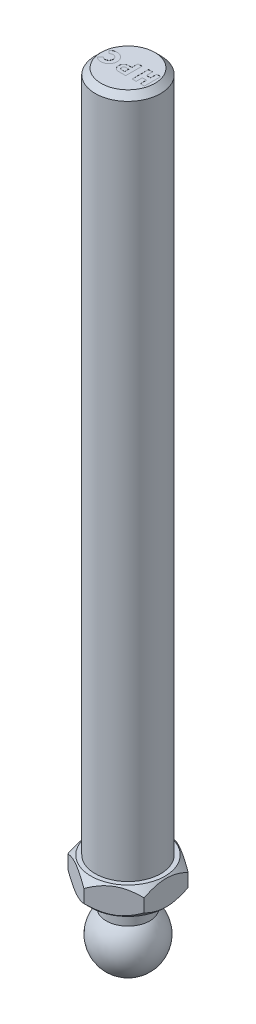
ISO-10303-21;
HEADER;
FILE_DESCRIPTION(('STEP AP214'),'2;1');
FILE_NAME('part.step','',(''),(''),'','','');
FILE_SCHEMA(('AUTOMOTIVE_DESIGN { 1 0 10303 214 1 1 1 1 }'));
ENDSEC;
DATA;
#1=APPLICATION_CONTEXT('core data for automotive mechanical design processes');
#2=APPLICATION_PROTOCOL_DEFINITION('international standard','automotive_design',2000,#1);
#3=PRODUCT_CONTEXT('',#1,'mechanical');
#4=PRODUCT('Part','Part','',(#3));
#5=PRODUCT_RELATED_PRODUCT_CATEGORY('part','',(#4));
#6=PRODUCT_DEFINITION_FORMATION('','',#4);
#7=PRODUCT_DEFINITION_CONTEXT('part definition',#1,'design');
#8=PRODUCT_DEFINITION('design','',#6,#7);
#9=PRODUCT_DEFINITION_SHAPE('','',#8);
#10=(LENGTH_UNIT() NAMED_UNIT(*) SI_UNIT(.MILLI.,.METRE.));
#11=(NAMED_UNIT(*) PLANE_ANGLE_UNIT() SI_UNIT($,.RADIAN.));
#12=(NAMED_UNIT(*) SI_UNIT($,.STERADIAN.) SOLID_ANGLE_UNIT());
#13=UNCERTAINTY_MEASURE_WITH_UNIT(LENGTH_MEASURE(1.E-05),#10,'distance_accuracy_value','');
#14=(GEOMETRIC_REPRESENTATION_CONTEXT(3) GLOBAL_UNCERTAINTY_ASSIGNED_CONTEXT((#13)) GLOBAL_UNIT_ASSIGNED_CONTEXT((#10,
#11,#12)) REPRESENTATION_CONTEXT('',''));
#15=CARTESIAN_POINT('',(0.,0.,0.));
#16=DIRECTION('',(0.,0.,1.));
#17=DIRECTION('',(1.,0.,0.));
#18=AXIS2_PLACEMENT_3D('',#15,#16,#17);
#19=CARTESIAN_POINT('',(0.,28.4210526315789,0.));
#20=DIRECTION('',(-1.,0.,0.));
#21=DIRECTION('',(0.,0.,1.));
#22=AXIS2_PLACEMENT_3D('',#19,#20,#21);
#23=SPHERICAL_SURFACE('',#22,5.71428571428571);
#24=CARTESIAN_POINT('',(5.7142857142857,28.4210526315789,0.));
#25=VERTEX_POINT('',#24);
#26=VERTEX_LOOP('',#25);
#27=FACE_BOUND('',#26,.T.);
#28=CARTESIAN_POINT('',(-5.71428571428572,28.4210526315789,0.));
#29=VERTEX_POINT('',#28);
#30=VERTEX_LOOP('',#29);
#31=FACE_BOUND('',#30,.T.);
#32=CARTESIAN_POINT('',(0.,32.5018688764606,0.));
#33=DIRECTION('',(0.,-1.,0.));
#34=DIRECTION('',(0.,0.,-1.));
#35=AXIS2_PLACEMENT_3D('',#32,#33,#34);
#36=CIRCLE('',#35,4.);
#37=CARTESIAN_POINT('',(0.,32.5018688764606,-4.));
#38=VERTEX_POINT('',#37);
#39=EDGE_CURVE('E20',#38,#38,#36,.F.);
#40=ORIENTED_EDGE('',*,*,#39,.F.);
#41=EDGE_LOOP('',(#40));
#42=FACE_BOUND('',#41,.T.);
#43=ADVANCED_FACE('F16',(#27,#31,#42),#23,.T.);
#44=CARTESIAN_POINT('',(-4.9265,166.,0.));
#45=DIRECTION('',(0.,-1.,0.));
#46=DIRECTION('',(0.,0.,-1.));
#47=AXIS2_PLACEMENT_3D('',#44,#45,#46);
#48=PLANE('',#47);
#49=DIRECTION('',(-1.,0.,0.));
#50=VECTOR('',#49,1.);
#51=CARTESIAN_POINT('',(0.267766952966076,166.,0.125));
#52=LINE('',#51,#50);
#53=CARTESIAN_POINT('',(-0.302404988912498,166.,0.124999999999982));
#54=VERTEX_POINT('',#53);
#55=CARTESIAN_POINT('',(0.267766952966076,166.,0.125));
#56=VERTEX_POINT('',#55);
#57=EDGE_CURVE('E628',#54,#56,#52,.F.);
#58=ORIENTED_EDGE('',*,*,#57,.F.);
#59=CARTESIAN_POINT('',(-0.302404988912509,166.,0.499999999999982));
#60=DIRECTION('',(0.,-1.,0.));
#61=DIRECTION('',(0.,0.,-1.));
#62=AXIS2_PLACEMENT_3D('',#59,#60,#61);
#63=CIRCLE('',#62,0.375);
#64=CARTESIAN_POINT('',(-0.302404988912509,166.,0.874999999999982));
#65=VERTEX_POINT('',#64);
#66=EDGE_CURVE('E130',#65,#54,#63,.T.);
#67=ORIENTED_EDGE('',*,*,#66,.F.);
#68=DIRECTION('',(1.,0.,0.));
#69=VECTOR('',#68,1.);
#70=CARTESIAN_POINT('',(-0.302404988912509,166.,0.874999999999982));
#71=LINE('',#70,#69);
#72=CARTESIAN_POINT('',(0.267766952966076,166.,0.874999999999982));
#73=VERTEX_POINT('',#72);
#74=EDGE_CURVE('E135',#73,#65,#71,.F.);
#75=ORIENTED_EDGE('',*,*,#74,.F.);
#76=DIRECTION('',(0.,0.,-1.));
#77=VECTOR('',#76,1.);
#78=CARTESIAN_POINT('',(0.267766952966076,166.,0.874999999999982));
#79=LINE('',#78,#77);
#80=EDGE_CURVE('E152',#56,#73,#79,.F.);
#81=ORIENTED_EDGE('',*,*,#80,.F.);
#82=EDGE_LOOP('',(#58,#67,#75,#81));
#83=FACE_BOUND('',#82,.T.);
#84=ADVANCED_FACE('F147',(#83),#48,.F.);
#85=CARTESIAN_POINT('',(0.,166.,0.));
#86=DIRECTION('',(0.,-1.,0.));
#87=DIRECTION('',(0.,0.,-1.));
#88=AXIS2_PLACEMENT_3D('',#85,#86,#87);
#89=CYLINDRICAL_SURFACE('',#88,4.);
#90=ORIENTED_EDGE('',*,*,#39,.T.);
#91=EDGE_LOOP('',(#90));
#92=FACE_BOUND('',#91,.T.);
#93=CARTESIAN_POINT('',(0.,36.,0.));
#94=DIRECTION('',(0.,-1.,0.));
#95=DIRECTION('',(0.,0.,-1.));
#96=AXIS2_PLACEMENT_3D('',#93,#94,#95);
#97=CIRCLE('',#96,4.);
#98=CARTESIAN_POINT('',(0.,36.,-4.));
#99=VERTEX_POINT('',#98);
#100=EDGE_CURVE('E624',#99,#99,#97,.T.);
#101=ORIENTED_EDGE('',*,*,#100,.T.);
#102=EDGE_LOOP('',(#101));
#103=FACE_BOUND('',#102,.T.);
#104=ADVANCED_FACE('F767',(#92,#103),#89,.T.);
#105=CARTESIAN_POINT('',(0.267766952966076,165.98,0.874999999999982));
#106=DIRECTION('',(1.,0.,0.));
#107=DIRECTION('',(0.,0.,-1.));
#108=AXIS2_PLACEMENT_3D('',#105,#106,#107);
#109=PLANE('',#108);
#110=DIRECTION('',(0.,0.,1.));
#111=VECTOR('',#110,1.);
#112=CARTESIAN_POINT('',(0.267766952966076,165.98,0.499999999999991));
#113=LINE('',#112,#111);
#114=CARTESIAN_POINT('',(0.267766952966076,165.98,0.124999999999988));
#115=VERTEX_POINT('',#114);
#116=CARTESIAN_POINT('',(0.267766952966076,165.98,0.874999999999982));
#117=VERTEX_POINT('',#116);
#118=EDGE_CURVE('E606',#115,#117,#113,.T.);
#119=ORIENTED_EDGE('',*,*,#118,.F.);
#120=DIRECTION('',(0.,1.,0.));
#121=VECTOR('',#120,1.);
#122=CARTESIAN_POINT('',(0.267766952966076,165.98,0.125));
#123=LINE('',#122,#121);
#124=EDGE_CURVE('E625',#56,#115,#123,.F.);
#125=ORIENTED_EDGE('',*,*,#124,.F.);
#126=ORIENTED_EDGE('',*,*,#80,.T.);
#127=DIRECTION('',(0.,1.,0.));
#128=VECTOR('',#127,1.);
#129=CARTESIAN_POINT('',(0.267766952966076,165.98,0.874999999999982));
#130=LINE('',#129,#128);
#131=EDGE_CURVE('E158',#117,#73,#130,.T.);
#132=ORIENTED_EDGE('',*,*,#131,.F.);
#133=EDGE_LOOP('',(#119,#125,#126,#132));
#134=FACE_BOUND('',#133,.T.);
#135=ADVANCED_FACE('F743',(#134),#109,.T.);
#136=CARTESIAN_POINT('',(-0.302404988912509,165.98,0.874999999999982));
#137=DIRECTION('',(0.,0.,1.));
#138=DIRECTION('',(1.,0.,0.));
#139=AXIS2_PLACEMENT_3D('',#136,#137,#138);
#140=PLANE('',#139);
#141=DIRECTION('',(1.,0.,0.));
#142=VECTOR('',#141,1.);
#143=CARTESIAN_POINT('',(-0.302405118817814,165.98,0.874999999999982));
#144=LINE('',#143,#142);
#145=CARTESIAN_POINT('',(-0.302404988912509,165.98,0.874999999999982));
#146=VERTEX_POINT('',#145);
#147=EDGE_CURVE('E603',#117,#146,#144,.F.);
#148=ORIENTED_EDGE('',*,*,#147,.F.);
#149=ORIENTED_EDGE('',*,*,#131,.T.);
#150=ORIENTED_EDGE('',*,*,#74,.T.);
#151=DIRECTION('',(0.,-1.,0.));
#152=VECTOR('',#151,1.);
#153=CARTESIAN_POINT('',(-0.302404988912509,165.98,0.874999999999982));
#154=LINE('',#153,#152);
#155=EDGE_CURVE('E635',#146,#65,#154,.F.);
#156=ORIENTED_EDGE('',*,*,#155,.F.);
#157=EDGE_LOOP('',(#148,#149,#150,#156));
#158=FACE_BOUND('',#157,.T.);
#159=ADVANCED_FACE('F745',(#158),#140,.T.);
#160=CARTESIAN_POINT('',(-0.302404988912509,165.98,0.499999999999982));
#161=DIRECTION('',(0.,-1.,0.));
#162=DIRECTION('',(0.,0.,-1.));
#163=AXIS2_PLACEMENT_3D('',#160,#161,#162);
#164=CYLINDRICAL_SURFACE('',#163,0.375);
#165=CARTESIAN_POINT('',(-0.302404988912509,165.98,0.499999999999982));
#166=DIRECTION('',(0.,-1.,0.));
#167=DIRECTION('',(0.,0.,-1.));
#168=AXIS2_PLACEMENT_3D('',#165,#166,#167);
#169=CIRCLE('',#168,0.375);
#170=CARTESIAN_POINT('',(-0.302404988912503,165.98,0.124999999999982));
#171=VERTEX_POINT('',#170);
#172=EDGE_CURVE('E600',#146,#171,#169,.T.);
#173=ORIENTED_EDGE('',*,*,#172,.F.);
#174=ORIENTED_EDGE('',*,*,#155,.T.);
#175=ORIENTED_EDGE('',*,*,#66,.T.);
#176=DIRECTION('',(0.,1.,0.));
#177=VECTOR('',#176,1.);
#178=CARTESIAN_POINT('',(-0.302404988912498,165.98,0.124999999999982));
#179=LINE('',#178,#177);
#180=EDGE_CURVE('E621',#171,#54,#179,.T.);
#181=ORIENTED_EDGE('',*,*,#180,.F.);
#182=EDGE_LOOP('',(#173,#174,#175,#181));
#183=FACE_BOUND('',#182,.T.);
#184=ADVANCED_FACE('F646',(#183),#164,.T.);
#185=CARTESIAN_POINT('',(0.267766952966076,165.98,0.125));
#186=DIRECTION('',(0.,0.,-1.));
#187=DIRECTION('',(-1.,0.,0.));
#188=AXIS2_PLACEMENT_3D('',#185,#186,#187);
#189=PLANE('',#188);
#190=DIRECTION('',(1.,0.,0.));
#191=VECTOR('',#190,1.);
#192=CARTESIAN_POINT('',(-0.302405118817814,165.98,0.124999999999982));
#193=LINE('',#192,#191);
#194=EDGE_CURVE('E590',#171,#115,#193,.T.);
#195=ORIENTED_EDGE('',*,*,#194,.F.);
#196=ORIENTED_EDGE('',*,*,#180,.T.);
#197=ORIENTED_EDGE('',*,*,#57,.T.);
#198=ORIENTED_EDGE('',*,*,#124,.T.);
#199=EDGE_LOOP('',(#195,#196,#197,#198));
#200=FACE_BOUND('',#199,.T.);
#201=ADVANCED_FACE('F643',(#200),#189,.T.);
#202=CARTESIAN_POINT('',(-4.,36.,0.));
#203=DIRECTION('',(0.,1.,0.));
#204=DIRECTION('',(0.,0.,1.));
#205=AXIS2_PLACEMENT_3D('',#202,#203,#204);
#206=PLANE('',#205);
#207=ORIENTED_EDGE('',*,*,#100,.F.);
#208=EDGE_LOOP('',(#207));
#209=FACE_BOUND('',#208,.T.);
#210=CARTESIAN_POINT('',(0.,36.0000000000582,0.));
#211=DIRECTION('',(0.,1.,0.));
#212=DIRECTION('',(0.,0.,1.));
#213=AXIS2_PLACEMENT_3D('',#210,#211,#212);
#214=CIRCLE('',#213,6.77586206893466);
#215=CARTESIAN_POINT('',(0.,36.0000000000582,6.77586206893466));
#216=VERTEX_POINT('',#215);
#217=EDGE_CURVE('E586',#216,#216,#214,.T.);
#218=ORIENTED_EDGE('',*,*,#217,.F.);
#219=EDGE_LOOP('',(#218));
#220=FACE_BOUND('',#219,.T.);
#221=ADVANCED_FACE('F749',(#209,#220),#206,.F.);
#222=CARTESIAN_POINT('',(-0.302405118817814,165.98,0.499999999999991));
#223=DIRECTION('',(0.,1.,0.));
#224=DIRECTION('',(0.,0.,1.));
#225=AXIS2_PLACEMENT_3D('',#222,#223,#224);
#226=PLANE('',#225);
#227=CARTESIAN_POINT('',(-0.302405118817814,165.98,0.499999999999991));
#228=DIRECTION('',(0.,-1.,0.));
#229=DIRECTION('',(0.,0.,-1.));
#230=AXIS2_PLACEMENT_3D('',#227,#228,#229);
#231=CIRCLE('',#230,0.937500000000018);
#232=CARTESIAN_POINT('',(-0.302405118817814,165.98,-0.437500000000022));
#233=VERTEX_POINT('',#232);
#234=CARTESIAN_POINT('',(-0.302405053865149,165.98,1.4375));
#235=VERTEX_POINT('',#234);
#236=EDGE_CURVE('E547',#233,#235,#231,.F.);
#237=ORIENTED_EDGE('',*,*,#236,.T.);
#238=DIRECTION('',(1.,0.,0.));
#239=VECTOR('',#238,1.);
#240=CARTESIAN_POINT('',(-0.302404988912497,165.98,1.4375));
#241=LINE('',#240,#239);
#242=CARTESIAN_POINT('',(1.01776695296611,165.98,1.43749999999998));
#243=VERTEX_POINT('',#242);
#244=EDGE_CURVE('E580',#235,#243,#241,.T.);
#245=ORIENTED_EDGE('',*,*,#244,.T.);
#246=DIRECTION('',(0.,0.,-1.));
#247=VECTOR('',#246,1.);
#248=CARTESIAN_POINT('',(1.01776695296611,165.98,1.43749999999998));
#249=LINE('',#248,#247);
#250=CARTESIAN_POINT('',(1.01776695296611,165.98,-1.5625));
#251=VERTEX_POINT('',#250);
#252=EDGE_CURVE('E570',#243,#251,#249,.T.);
#253=ORIENTED_EDGE('',*,*,#252,.T.);
#254=DIRECTION('',(-1.,0.,0.));
#255=VECTOR('',#254,1.);
#256=CARTESIAN_POINT('',(1.01776695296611,165.98,-1.5625));
#257=LINE('',#256,#255);
#258=CARTESIAN_POINT('',(0.267766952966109,165.98,-1.5625));
#259=VERTEX_POINT('',#258);
#260=EDGE_CURVE('E561',#251,#259,#257,.T.);
#261=ORIENTED_EDGE('',*,*,#260,.T.);
#262=DIRECTION('',(0.,0.,1.));
#263=VECTOR('',#262,1.);
#264=CARTESIAN_POINT('',(0.267766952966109,165.98,-1.5625));
#265=LINE('',#264,#263);
#266=CARTESIAN_POINT('',(0.267766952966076,165.98,-0.437500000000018));
#267=VERTEX_POINT('',#266);
#268=EDGE_CURVE('E553',#259,#267,#265,.T.);
#269=ORIENTED_EDGE('',*,*,#268,.T.);
#270=DIRECTION('',(-1.,0.,0.));
#271=VECTOR('',#270,1.);
#272=CARTESIAN_POINT('',(0.267766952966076,165.98,-0.437500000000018));
#273=LINE('',#272,#271);
#274=EDGE_CURVE('E552',#267,#233,#273,.T.);
#275=ORIENTED_EDGE('',*,*,#274,.T.);
#276=EDGE_LOOP('',(#237,#245,#253,#261,#269,#275));
#277=FACE_BOUND('',#276,.T.);
#278=ORIENTED_EDGE('',*,*,#172,.T.);
#279=ORIENTED_EDGE('',*,*,#194,.T.);
#280=ORIENTED_EDGE('',*,*,#118,.T.);
#281=ORIENTED_EDGE('',*,*,#147,.T.);
#282=EDGE_LOOP('',(#278,#279,#280,#281));
#283=FACE_BOUND('',#282,.T.);
#284=ADVANCED_FACE('F747',(#277,#283),#226,.T.);
#285=CARTESIAN_POINT('',(-3.47689858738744,165.98,0.));
#286=DIRECTION('',(0.,1.,0.));
#287=DIRECTION('',(0.,0.,1.));
#288=AXIS2_PLACEMENT_3D('',#285,#286,#287);
#289=PLANE('',#288);
#290=DIRECTION('',(0.70710678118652,0.,0.707106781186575));
#291=VECTOR('',#290,1.);
#292=CARTESIAN_POINT('',(-4.53755875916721,165.98,-1.06066017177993));
#293=LINE('',#292,#291);
#294=CARTESIAN_POINT('',(-4.53755875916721,165.98,-1.06066017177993));
#295=VERTEX_POINT('',#294);
#296=CARTESIAN_POINT('',(-4.00722867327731,165.98,-0.530330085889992));
#297=VERTEX_POINT('',#296);
#298=EDGE_CURVE('E542',#295,#297,#293,.T.);
#299=ORIENTED_EDGE('',*,*,#298,.T.);
#300=CARTESIAN_POINT('',(-3.47689858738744,165.98,0.));
#301=DIRECTION('',(0.,-1.,0.));
#302=DIRECTION('',(0.,0.,-1.));
#303=AXIS2_PLACEMENT_3D('',#300,#301,#302);
#304=CIRCLE('',#303,0.75);
#305=CARTESIAN_POINT('',(-4.0072286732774,165.98,0.530330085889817));
#306=VERTEX_POINT('',#305);
#307=EDGE_CURVE('E538',#306,#297,#304,.F.);
#308=ORIENTED_EDGE('',*,*,#307,.F.);
#309=DIRECTION('',(-0.707106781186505,0.,0.70710678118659));
#310=VECTOR('',#309,1.);
#311=CARTESIAN_POINT('',(-4.0072286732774,165.98,0.530330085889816));
#312=LINE('',#311,#310);
#313=CARTESIAN_POINT('',(-4.53755875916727,165.98,1.06066017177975));
#314=VERTEX_POINT('',#313);
#315=EDGE_CURVE('E587',#306,#314,#312,.T.);
#316=ORIENTED_EDGE('',*,*,#315,.T.);
#317=CARTESIAN_POINT('',(-3.47689858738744,165.98,0.));
#318=DIRECTION('',(0.,-1.,0.));
#319=DIRECTION('',(0.,0.,-1.));
#320=AXIS2_PLACEMENT_3D('',#317,#318,#319);
#321=CIRCLE('',#320,1.5);
#322=EDGE_CURVE('E543',#314,#295,#321,.F.);
#323=ORIENTED_EDGE('',*,*,#322,.T.);
#324=EDGE_LOOP('',(#299,#308,#316,#323));
#325=FACE_BOUND('',#324,.T.);
#326=ADVANCED_FACE('F660',(#325),#289,.T.);
#327=CARTESIAN_POINT('',(0.,165.98,0.));
#328=DIRECTION('',(0.,1.,0.));
#329=DIRECTION('',(0.,0.,1.));
#330=AXIS2_PLACEMENT_3D('',#327,#328,#329);
#331=PLANE('',#330);
#332=DIRECTION('',(0.,0.,1.));
#333=VECTOR('',#332,1.);
#334=CARTESIAN_POINT('',(3.63743249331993,165.98,0.25));
#335=LINE('',#334,#333);
#336=CARTESIAN_POINT('',(3.63743249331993,165.98,0.25));
#337=VERTEX_POINT('',#336);
#338=CARTESIAN_POINT('',(3.63743249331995,165.98,1.375));
#339=VERTEX_POINT('',#338);
#340=EDGE_CURVE('E479',#337,#339,#335,.T.);
#341=ORIENTED_EDGE('',*,*,#340,.T.);
#342=DIRECTION('',(1.,0.,0.));
#343=VECTOR('',#342,1.);
#344=CARTESIAN_POINT('',(3.63743249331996,165.98,1.375));
#345=LINE('',#344,#343);
#346=CARTESIAN_POINT('',(4.38743249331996,165.98,1.37499999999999));
#347=VERTEX_POINT('',#346);
#348=EDGE_CURVE('E473',#339,#347,#345,.T.);
#349=ORIENTED_EDGE('',*,*,#348,.T.);
#350=DIRECTION('',(0.,0.,-1.));
#351=VECTOR('',#350,1.);
#352=CARTESIAN_POINT('',(4.38743249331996,165.98,1.37499999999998));
#353=LINE('',#352,#351);
#354=CARTESIAN_POINT('',(4.38743249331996,165.98,-1.625));
#355=VERTEX_POINT('',#354);
#356=EDGE_CURVE('E467',#347,#355,#353,.T.);
#357=ORIENTED_EDGE('',*,*,#356,.T.);
#358=DIRECTION('',(1.,0.,0.));
#359=VECTOR('',#358,1.);
#360=CARTESIAN_POINT('',(0.,165.98,-1.625));
#361=LINE('',#360,#359);
#362=CARTESIAN_POINT('',(3.63743249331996,165.98,-1.625));
#363=VERTEX_POINT('',#362);
#364=EDGE_CURVE('E583',#355,#363,#361,.F.);
#365=ORIENTED_EDGE('',*,*,#364,.T.);
#366=DIRECTION('',(0.,0.,1.));
#367=VECTOR('',#366,1.);
#368=CARTESIAN_POINT('',(3.63743249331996,165.98,-1.625));
#369=LINE('',#368,#367);
#370=CARTESIAN_POINT('',(3.63743249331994,165.98,-0.5));
#371=VERTEX_POINT('',#370);
#372=EDGE_CURVE('E527',#363,#371,#369,.T.);
#373=ORIENTED_EDGE('',*,*,#372,.T.);
#374=DIRECTION('',(-1.,0.,0.));
#375=VECTOR('',#374,1.);
#376=CARTESIAN_POINT('',(3.63743249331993,165.98,-0.5));
#377=LINE('',#376,#375);
#378=CARTESIAN_POINT('',(2.88743249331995,165.98,-0.5));
#379=VERTEX_POINT('',#378);
#380=EDGE_CURVE('E521',#371,#379,#377,.T.);
#381=ORIENTED_EDGE('',*,*,#380,.T.);
#382=DIRECTION('',(0.,0.,-1.));
#383=VECTOR('',#382,1.);
#384=CARTESIAN_POINT('',(2.88743249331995,165.98,-0.5));
#385=LINE('',#384,#383);
#386=CARTESIAN_POINT('',(2.88743249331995,165.98,-1.62500000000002));
#387=VERTEX_POINT('',#386);
#388=EDGE_CURVE('E515',#379,#387,#385,.T.);
#389=ORIENTED_EDGE('',*,*,#388,.T.);
#390=DIRECTION('',(-1.,0.,0.));
#391=VECTOR('',#390,1.);
#392=CARTESIAN_POINT('',(2.88743249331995,165.98,-1.62500000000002));
#393=LINE('',#392,#391);
#394=CARTESIAN_POINT('',(2.13743249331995,165.98,-1.62500000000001));
#395=VERTEX_POINT('',#394);
#396=EDGE_CURVE('E509',#387,#395,#393,.T.);
#397=ORIENTED_EDGE('',*,*,#396,.T.);
#398=DIRECTION('',(0.,0.,1.));
#399=VECTOR('',#398,1.);
#400=CARTESIAN_POINT('',(2.13743249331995,165.98,-1.625));
#401=LINE('',#400,#399);
#402=CARTESIAN_POINT('',(2.13743249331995,165.98,1.37499999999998));
#403=VERTEX_POINT('',#402);
#404=EDGE_CURVE('E503',#395,#403,#401,.T.);
#405=ORIENTED_EDGE('',*,*,#404,.T.);
#406=DIRECTION('',(1.,0.,0.));
#407=VECTOR('',#406,1.);
#408=CARTESIAN_POINT('',(2.13743249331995,165.98,1.37499999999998));
#409=LINE('',#408,#407);
#410=CARTESIAN_POINT('',(2.88743249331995,165.98,1.37499999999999));
#411=VERTEX_POINT('',#410);
#412=EDGE_CURVE('E497',#403,#411,#409,.T.);
#413=ORIENTED_EDGE('',*,*,#412,.T.);
#414=DIRECTION('',(0.,0.,-1.));
#415=VECTOR('',#414,1.);
#416=CARTESIAN_POINT('',(2.88743249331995,165.98,1.375));
#417=LINE('',#416,#415);
#418=CARTESIAN_POINT('',(2.88743249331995,165.98,0.25));
#419=VERTEX_POINT('',#418);
#420=EDGE_CURVE('E491',#411,#419,#417,.T.);
#421=ORIENTED_EDGE('',*,*,#420,.T.);
#422=DIRECTION('',(1.,0.,0.));
#423=VECTOR('',#422,1.);
#424=CARTESIAN_POINT('',(2.88743249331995,165.98,0.25));
#425=LINE('',#424,#423);
#426=EDGE_CURVE('E485',#419,#337,#425,.T.);
#427=ORIENTED_EDGE('',*,*,#426,.T.);
#428=EDGE_LOOP('',(#341,#349,#357,#365,#373,#381,#389,#397,#405,#413,#421,#427));
#429=FACE_BOUND('',#428,.T.);
#430=ADVANCED_FACE('F226',(#429),#331,.T.);
#431=CARTESIAN_POINT('',(0.,37.3148839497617,0.));
#432=DIRECTION('',(0.,1.,0.));
#433=DIRECTION('',(0.,0.,1.));
#434=AXIS2_PLACEMENT_3D('',#431,#432,#433);
#435=CONICAL_SURFACE('',#434,8.09074601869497,0.785398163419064);
#436=ORIENTED_EDGE('',*,*,#217,.T.);
#437=EDGE_LOOP('',(#436));
#438=FACE_BOUND('',#437,.T.);
#439=CARTESIAN_POINT('',(7.00000000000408,37.3070416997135,4.04145188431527));
#440=CARTESIAN_POINT('',(7.0000000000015,37.237566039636,3.90247970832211));
#441=CARTESIAN_POINT('',(7.00000000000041,37.1702226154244,3.76243936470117));
#442=CARTESIAN_POINT('',(6.99999999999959,37.0404488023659,3.48001282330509));
#443=CARTESIAN_POINT('',(6.99999999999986,36.9780210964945,3.3376253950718));
#444=CARTESIAN_POINT('',(7.00000000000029,36.7985521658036,2.90530569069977));
#445=CARTESIAN_POINT('',(7.00000000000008,36.6900905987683,2.61171385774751));
#446=CARTESIAN_POINT('',(6.99999999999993,36.5043582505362,2.01966264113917));
#447=CARTESIAN_POINT('',(6.99999999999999,36.4266196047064,1.72135454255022));
#448=CARTESIAN_POINT('',(7.00000000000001,36.336695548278,1.26898870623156));
#449=CARTESIAN_POINT('',(7.,36.3111802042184,1.11753415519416));
#450=CARTESIAN_POINT('',(7.,36.2696214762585,0.813342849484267));
#451=CARTESIAN_POINT('',(7.,36.2535766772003,0.660606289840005));
#452=CARTESIAN_POINT('',(7.,36.2266745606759,0.288395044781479));
#453=CARTESIAN_POINT('',(7.,36.2210307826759,0.0685192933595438));
#454=CARTESIAN_POINT('',(7.,36.2305088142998,-0.370835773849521));
#455=CARTESIAN_POINT('',(7.,36.2456379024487,-0.590314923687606));
#456=CARTESIAN_POINT('',(7.,36.2957698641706,-1.02720385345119));
#457=CARTESIAN_POINT('',(7.,36.3307949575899,-1.24461104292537));
#458=CARTESIAN_POINT('',(7.,36.4188147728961,-1.67568866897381));
#459=CARTESIAN_POINT('',(7.,36.4718081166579,-1.88935939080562));
#460=CARTESIAN_POINT('',(7.,36.5808237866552,-2.26863721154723));
#461=CARTESIAN_POINT('',(7.,36.6339774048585,-2.43508465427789));
#462=CARTESIAN_POINT('',(7.,36.7488489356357,-2.76499207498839));
#463=CARTESIAN_POINT('',(7.,36.8105671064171,-2.92845196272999));
#464=CARTESIAN_POINT('',(7.,36.9411845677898,-3.2518693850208));
#465=CARTESIAN_POINT('',(7.,37.0100612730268,-3.41183611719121));
#466=CARTESIAN_POINT('',(7.,37.1540918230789,-3.72880792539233));
#467=CARTESIAN_POINT('',(7.,37.2292418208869,-3.8858147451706));
#468=CARTESIAN_POINT('',(7.,37.3070416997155,-4.04145188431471));
#469=B_SPLINE_CURVE_WITH_KNOTS('',3,(#439,#440,#441,#442,#443,#444,#445,#446,#447,#448,#449,
#450,#451,#452,#453,#454,#455,#456,#457,#458,#459,#460,#461,#462,#463,#464,#465,#466,#467,#468),
.UNSPECIFIED.,.F.,.F.,(4,2,2,2,2,2,2,2,2,2,2,2,2,2,4),(0.,0.466085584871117,0.932423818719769,
1.87013398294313,2.79295648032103,3.25346288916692,3.71390046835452,4.37271974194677,
5.0317699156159,5.69155756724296,6.35129462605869,6.87523436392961,7.39918990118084,
7.92153983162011,8.44357175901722),.UNSPECIFIED.);
#470=CARTESIAN_POINT('',(6.99999999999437,37.3070416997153,4.04145188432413));
#471=VERTEX_POINT('',#470);
#472=CARTESIAN_POINT('',(6.99999999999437,37.3070416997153,-4.04145188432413));
#473=VERTEX_POINT('',#472);
#474=EDGE_CURVE('E215',#471,#473,#469,.T.);
#475=ORIENTED_EDGE('',*,*,#474,.F.);
#476=CARTESIAN_POINT('',(1.25245254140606E-11,37.3070416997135,8.08290376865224));
#477=CARTESIAN_POINT('',(0.120353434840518,37.237566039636,8.01341768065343));
#478=CARTESIAN_POINT('',(0.241631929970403,37.1702226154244,7.94339750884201));
#479=CARTESIAN_POINT('',(0.486220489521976,37.0404488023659,7.80218423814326));
#480=CARTESIAN_POINT('',(0.609531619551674,36.9780210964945,7.73099052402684));
#481=CARTESIAN_POINT('',(0.983931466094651,36.7985521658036,7.5148306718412));
#482=CARTESIAN_POINT('',(1.23818945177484,36.6900905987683,7.36803475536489));
#483=CARTESIAN_POINT('',(1.75092084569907,36.5043582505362,7.07200914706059));
#484=CARTESIAN_POINT('',(2.00926323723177,36.4266196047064,6.92285509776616));
#485=CARTESIAN_POINT('',(2.40102354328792,36.336695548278,6.69667217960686));
#486=CARTESIAN_POINT('',(2.53218703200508,36.3111802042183,6.62094490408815));
#487=CARTESIAN_POINT('',(2.79562443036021,36.2696214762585,6.4688492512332));
#488=CARTESIAN_POINT('',(2.92789817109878,36.2535766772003,6.39248097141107));
#489=CARTESIAN_POINT('',(3.25024256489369,36.2266745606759,6.20637534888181));
#490=CARTESIAN_POINT('',(3.44066055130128,36.2210307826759,6.09643747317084));
#491=CARTESIAN_POINT('',(3.82115320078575,36.2305088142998,5.87675993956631));
#492=CARTESIAN_POINT('',(4.01122772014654,36.2456379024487,5.76702036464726));
#493=CARTESIAN_POINT('',(4.389584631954,36.2957698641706,5.54857589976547));
#494=CARTESIAN_POINT('',(4.57786478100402,36.3307949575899,5.43987230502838));
#495=CARTESIAN_POINT('',(4.95118895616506,36.4188147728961,5.22433349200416));
#496=CARTESIAN_POINT('',(5.13623322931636,36.4718081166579,5.11749813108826));
#497=CARTESIAN_POINT('',(5.4646974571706,36.5808237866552,4.92785922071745));
#498=CARTESIAN_POINT('',(5.60884517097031,36.6339774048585,4.84463549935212));
#499=CARTESIAN_POINT('',(5.8945533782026,36.7488489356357,4.67968178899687));
#500=CARTESIAN_POINT('',(6.03611379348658,36.8105671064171,4.59795184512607));
#501=CARTESIAN_POINT('',(6.3162014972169,36.9411845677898,4.43624313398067));
#502=CARTESIAN_POINT('',(6.45473675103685,37.0100612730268,4.35625976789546));
#503=CARTESIAN_POINT('',(6.72924238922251,37.1540918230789,4.1977738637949));
#504=CARTESIAN_POINT('',(6.86521428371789,37.2292418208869,4.11927045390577));
#505=CARTESIAN_POINT('',(6.99999999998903,37.3070416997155,4.04145188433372));
#506=B_SPLINE_CURVE_WITH_KNOTS('',3,(#476,#477,#478,#479,#480,#481,#482,#483,#484,#485,#486,
#487,#488,#489,#490,#491,#492,#493,#494,#495,#496,#497,#498,#499,#500,#501,#502,#503,#504,#505),
.UNSPECIFIED.,.F.,.F.,(4,2,2,2,2,2,2,2,2,2,2,2,2,2,4),(0.,0.466085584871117,0.93242381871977,
1.87013398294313,2.79295648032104,3.25346288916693,3.71390046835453,4.37271974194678,
5.03176991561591,5.69155756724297,6.3512946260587,6.87523436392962,7.39918990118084,
7.92153983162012,8.44357175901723),.UNSPECIFIED.);
#507=CARTESIAN_POINT('',(0.,37.3070416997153,8.08290376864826));
#508=VERTEX_POINT('',#507);
#509=EDGE_CURVE('E243',#508,#471,#506,.T.);
#510=ORIENTED_EDGE('',*,*,#509,.F.);
#511=CARTESIAN_POINT('',(-6.99999999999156,37.3070416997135,4.04145188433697));
#512=CARTESIAN_POINT('',(-6.87964656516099,37.237566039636,4.11093797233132));
#513=CARTESIAN_POINT('',(-6.75836807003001,37.1702226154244,4.18095814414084));
#514=CARTESIAN_POINT('',(-6.51377951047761,37.0404488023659,4.32217141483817));
#515=CARTESIAN_POINT('',(-6.39046838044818,36.9780210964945,4.39336512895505));
#516=CARTESIAN_POINT('',(-6.01606853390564,36.7985521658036,4.60952498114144));
#517=CARTESIAN_POINT('',(-5.76181054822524,36.6900905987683,4.75632089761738));
#518=CARTESIAN_POINT('',(-5.24907915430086,36.5043582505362,5.05234650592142));
#519=CARTESIAN_POINT('',(-4.99073676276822,36.4266196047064,5.20150055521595));
#520=CARTESIAN_POINT('',(-4.59897645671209,36.336695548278,5.42768347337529));
#521=CARTESIAN_POINT('',(-4.46781296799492,36.3111802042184,5.50341074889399));
#522=CARTESIAN_POINT('',(-4.2043755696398,36.2696214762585,5.65550640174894));
#523=CARTESIAN_POINT('',(-4.07210182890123,36.2535766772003,5.73187468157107));
#524=CARTESIAN_POINT('',(-3.74975743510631,36.2266745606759,5.91798030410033));
#525=CARTESIAN_POINT('',(-3.55933944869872,36.2210307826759,6.0279181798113));
#526=CARTESIAN_POINT('',(-3.17884679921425,36.2305088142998,6.24759571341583));
#527=CARTESIAN_POINT('',(-2.98877227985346,36.2456379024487,6.35733528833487));
#528=CARTESIAN_POINT('',(-2.610415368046,36.2957698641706,6.57577975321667));
#529=CARTESIAN_POINT('',(-2.42213521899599,36.3307949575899,6.68448334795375));
#530=CARTESIAN_POINT('',(-2.04881104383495,36.4188147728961,6.90002216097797));
#531=CARTESIAN_POINT('',(-1.86376677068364,36.4718081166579,7.00685752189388));
#532=CARTESIAN_POINT('',(-1.53530254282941,36.5808237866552,7.19649643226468));
#533=CARTESIAN_POINT('',(-1.3911548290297,36.6339774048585,7.27972015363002));
#534=CARTESIAN_POINT('',(-1.10544662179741,36.7488489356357,7.44467386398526));
#535=CARTESIAN_POINT('',(-0.963886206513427,36.8105671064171,7.52640380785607));
#536=CARTESIAN_POINT('',(-0.683798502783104,36.9411845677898,7.68811251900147));
#537=CARTESIAN_POINT('',(-0.54526324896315,37.0100612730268,7.76809588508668));
#538=CARTESIAN_POINT('',(-0.270757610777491,37.1540918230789,7.92658178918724));
#539=CARTESIAN_POINT('',(-0.134785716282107,37.2292418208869,8.00508519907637));
#540=CARTESIAN_POINT('',(-1.09721230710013E-11,37.3070416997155,8.08290376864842));
#541=B_SPLINE_CURVE_WITH_KNOTS('',3,(#511,#512,#513,#514,#515,#516,#517,#518,#519,#520,#521,
#522,#523,#524,#525,#526,#527,#528,#529,#530,#531,#532,#533,#534,#535,#536,#537,#538,#539,#540),
.UNSPECIFIED.,.F.,.F.,(4,2,2,2,2,2,2,2,2,2,2,2,2,2,4),(0.,0.46608558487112,0.932423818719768,
1.87013398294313,2.79295648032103,3.25346288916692,3.71390046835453,4.37271974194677,
5.0317699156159,5.69155756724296,6.35129462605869,6.87523436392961,7.39918990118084,
7.92153983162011,8.44357175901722),.UNSPECIFIED.);
#542=CARTESIAN_POINT('',(-6.99999999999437,37.3070416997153,4.04145188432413));
#543=VERTEX_POINT('',#542);
#544=EDGE_CURVE('E248',#543,#508,#541,.T.);
#545=ORIENTED_EDGE('',*,*,#544,.F.);
#546=CARTESIAN_POINT('',(-7.00000000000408,37.3070416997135,-4.04145188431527));
#547=CARTESIAN_POINT('',(-7.0000000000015,37.237566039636,-3.90247970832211));
#548=CARTESIAN_POINT('',(-7.00000000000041,37.1702226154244,-3.76243936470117));
#549=CARTESIAN_POINT('',(-6.99999999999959,37.0404488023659,-3.48001282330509));
#550=CARTESIAN_POINT('',(-6.99999999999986,36.9780210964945,-3.3376253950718));
#551=CARTESIAN_POINT('',(-7.00000000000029,36.7985521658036,-2.90530569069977));
#552=CARTESIAN_POINT('',(-7.00000000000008,36.6900905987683,-2.61171385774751));
#553=CARTESIAN_POINT('',(-6.99999999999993,36.5043582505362,-2.01966264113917));
#554=CARTESIAN_POINT('',(-6.99999999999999,36.4266196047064,-1.72135454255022));
#555=CARTESIAN_POINT('',(-7.00000000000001,36.336695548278,-1.26898870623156));
#556=CARTESIAN_POINT('',(-7.,36.3111802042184,-1.11753415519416));
#557=CARTESIAN_POINT('',(-7.,36.2696214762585,-0.813342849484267));
#558=CARTESIAN_POINT('',(-7.,36.2535766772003,-0.660606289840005));
#559=CARTESIAN_POINT('',(-7.,36.2266745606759,-0.288395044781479));
#560=CARTESIAN_POINT('',(-7.,36.2210307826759,-0.0685192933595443));
#561=CARTESIAN_POINT('',(-7.,36.2305088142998,0.370835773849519));
#562=CARTESIAN_POINT('',(-7.,36.2456379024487,0.590314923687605));
#563=CARTESIAN_POINT('',(-7.,36.2957698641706,1.02720385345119));
#564=CARTESIAN_POINT('',(-7.,36.3307949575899,1.24461104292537));
#565=CARTESIAN_POINT('',(-7.,36.4188147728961,1.67568866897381));
#566=CARTESIAN_POINT('',(-7.,36.4718081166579,1.88935939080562));
#567=CARTESIAN_POINT('',(-7.,36.5808237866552,2.26863721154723));
#568=CARTESIAN_POINT('',(-7.,36.6339774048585,2.43508465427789));
#569=CARTESIAN_POINT('',(-7.,36.7488489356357,2.76499207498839));
#570=CARTESIAN_POINT('',(-7.,36.8105671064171,2.92845196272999));
#571=CARTESIAN_POINT('',(-7.,36.9411845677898,3.2518693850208));
#572=CARTESIAN_POINT('',(-7.,37.0100612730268,3.41183611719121));
#573=CARTESIAN_POINT('',(-7.,37.1540918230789,3.72880792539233));
#574=CARTESIAN_POINT('',(-7.,37.2292418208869,3.8858147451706));
#575=CARTESIAN_POINT('',(-7.,37.3070416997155,4.04145188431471));
#576=B_SPLINE_CURVE_WITH_KNOTS('',3,(#546,#547,#548,#549,#550,#551,#552,#553,#554,#555,#556,
#557,#558,#559,#560,#561,#562,#563,#564,#565,#566,#567,#568,#569,#570,#571,#572,#573,#574,#575),
.UNSPECIFIED.,.F.,.F.,(4,2,2,2,2,2,2,2,2,2,2,2,2,2,4),(0.,0.466085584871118,0.93242381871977,
1.87013398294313,2.79295648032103,3.25346288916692,3.71390046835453,4.37271974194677,
5.0317699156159,5.69155756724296,6.35129462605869,6.87523436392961,7.39918990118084,
7.92153983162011,8.44357175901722),.UNSPECIFIED.);
#577=CARTESIAN_POINT('',(-6.99999999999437,37.3070416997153,-4.04145188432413));
#578=VERTEX_POINT('',#577);
#579=EDGE_CURVE('E256',#578,#543,#576,.T.);
#580=ORIENTED_EDGE('',*,*,#579,.F.);
#581=CARTESIAN_POINT('',(-1.25247661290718E-11,37.3070416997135,-8.08290376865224));
#582=CARTESIAN_POINT('',(-0.120353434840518,37.237566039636,-8.01341768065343));
#583=CARTESIAN_POINT('',(-0.241631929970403,37.1702226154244,-7.94339750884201));
#584=CARTESIAN_POINT('',(-0.486220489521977,37.0404488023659,-7.80218423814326));
#585=CARTESIAN_POINT('',(-0.609531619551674,36.9780210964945,-7.73099052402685));
#586=CARTESIAN_POINT('',(-0.983931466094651,36.7985521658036,-7.5148306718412));
#587=CARTESIAN_POINT('',(-1.23818945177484,36.6900905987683,-7.36803475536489));
#588=CARTESIAN_POINT('',(-1.75092084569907,36.5043582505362,-7.07200914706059));
#589=CARTESIAN_POINT('',(-2.00926323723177,36.4266196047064,-6.92285509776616));
#590=CARTESIAN_POINT('',(-2.40102354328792,36.336695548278,-6.69667217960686));
#591=CARTESIAN_POINT('',(-2.53218703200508,36.3111802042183,-6.62094490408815));
#592=CARTESIAN_POINT('',(-2.79562443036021,36.2696214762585,-6.4688492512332));
#593=CARTESIAN_POINT('',(-2.92789817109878,36.2535766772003,-6.39248097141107));
#594=CARTESIAN_POINT('',(-3.2502425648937,36.2266745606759,-6.20637534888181));
#595=CARTESIAN_POINT('',(-3.44066055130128,36.2210307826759,-6.09643747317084));
#596=CARTESIAN_POINT('',(-3.82115320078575,36.2305088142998,-5.87675993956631));
#597=CARTESIAN_POINT('',(-4.01122772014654,36.2456379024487,-5.76702036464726));
#598=CARTESIAN_POINT('',(-4.38958463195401,36.2957698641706,-5.54857589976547));
#599=CARTESIAN_POINT('',(-4.57786478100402,36.3307949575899,-5.43987230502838));
#600=CARTESIAN_POINT('',(-4.95118895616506,36.4188147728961,-5.22433349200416));
#601=CARTESIAN_POINT('',(-5.13623322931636,36.4718081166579,-5.11749813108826));
#602=CARTESIAN_POINT('',(-5.4646974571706,36.5808237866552,-4.92785922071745));
#603=CARTESIAN_POINT('',(-5.60884517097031,36.6339774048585,-4.84463549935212));
#604=CARTESIAN_POINT('',(-5.8945533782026,36.7488489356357,-4.67968178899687));
#605=CARTESIAN_POINT('',(-6.03611379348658,36.8105671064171,-4.59795184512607));
#606=CARTESIAN_POINT('',(-6.3162014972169,36.9411845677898,-4.43624313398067));
#607=CARTESIAN_POINT('',(-6.45473675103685,37.0100612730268,-4.35625976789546));
#608=CARTESIAN_POINT('',(-6.72924238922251,37.1540918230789,-4.1977738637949));
#609=CARTESIAN_POINT('',(-6.86521428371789,37.2292418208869,-4.11927045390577));
#610=CARTESIAN_POINT('',(-6.99999999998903,37.3070416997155,-4.04145188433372));
#611=B_SPLINE_CURVE_WITH_KNOTS('',3,(#581,#582,#583,#584,#585,#586,#587,#588,#589,#590,#591,
#592,#593,#594,#595,#596,#597,#598,#599,#600,#601,#602,#603,#604,#605,#606,#607,#608,#609,#610),
.UNSPECIFIED.,.F.,.F.,(4,2,2,2,2,2,2,2,2,2,2,2,2,2,4),(0.,0.466085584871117,0.93242381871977,
1.87013398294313,2.79295648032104,3.25346288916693,3.71390046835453,4.37271974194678,
5.03176991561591,5.69155756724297,6.3512946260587,6.87523436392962,7.39918990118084,
7.92153983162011,8.44357175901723),.UNSPECIFIED.);
#612=CARTESIAN_POINT('',(-5.62973775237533E-12,37.3070416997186,-8.08290376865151));
#613=VERTEX_POINT('',#612);
#614=EDGE_CURVE('E233',#613,#578,#611,.T.);
#615=ORIENTED_EDGE('',*,*,#614,.F.);
#616=CARTESIAN_POINT('',(6.99999999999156,37.3070416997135,-4.04145188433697));
#617=CARTESIAN_POINT('',(6.87964656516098,37.237566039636,-4.11093797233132));
#618=CARTESIAN_POINT('',(6.75836807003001,37.1702226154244,-4.18095814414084));
#619=CARTESIAN_POINT('',(6.51377951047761,37.0404488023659,-4.32217141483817));
#620=CARTESIAN_POINT('',(6.39046838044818,36.9780210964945,-4.39336512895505));
#621=CARTESIAN_POINT('',(6.01606853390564,36.7985521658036,-4.60952498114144));
#622=CARTESIAN_POINT('',(5.76181054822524,36.6900905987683,-4.75632089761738));
#623=CARTESIAN_POINT('',(5.24907915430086,36.5043582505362,-5.05234650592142));
#624=CARTESIAN_POINT('',(4.99073676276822,36.4266196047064,-5.20150055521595));
#625=CARTESIAN_POINT('',(4.59897645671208,36.336695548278,-5.4276834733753));
#626=CARTESIAN_POINT('',(4.46781296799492,36.3111802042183,-5.503410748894));
#627=CARTESIAN_POINT('',(4.20437556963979,36.2696214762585,-5.65550640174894));
#628=CARTESIAN_POINT('',(4.07210182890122,36.2535766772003,-5.73187468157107));
#629=CARTESIAN_POINT('',(3.7497574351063,36.2266745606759,-5.91798030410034));
#630=CARTESIAN_POINT('',(3.55933944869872,36.2210307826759,-6.0279181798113));
#631=CARTESIAN_POINT('',(3.17884679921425,36.2305088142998,-6.24759571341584));
#632=CARTESIAN_POINT('',(2.98877227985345,36.2456379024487,-6.35733528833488));
#633=CARTESIAN_POINT('',(2.61041536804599,36.2957698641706,-6.57577975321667));
#634=CARTESIAN_POINT('',(2.42213521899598,36.3307949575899,-6.68448334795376));
#635=CARTESIAN_POINT('',(2.04881104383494,36.4188147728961,-6.90002216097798));
#636=CARTESIAN_POINT('',(1.86376677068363,36.4718081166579,-7.00685752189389));
#637=CARTESIAN_POINT('',(1.5353025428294,36.5808237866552,-7.19649643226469));
#638=CARTESIAN_POINT('',(1.39115482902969,36.6339774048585,-7.27972015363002));
#639=CARTESIAN_POINT('',(1.1054466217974,36.7488489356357,-7.44467386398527));
#640=CARTESIAN_POINT('',(0.963886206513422,36.8105671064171,-7.52640380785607));
#641=CARTESIAN_POINT('',(0.683798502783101,36.9411845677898,-7.68811251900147));
#642=CARTESIAN_POINT('',(0.545263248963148,37.0100612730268,-7.76809588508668));
#643=CARTESIAN_POINT('',(0.270757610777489,37.1540918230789,-7.92658178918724));
#644=CARTESIAN_POINT('',(0.134785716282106,37.2292418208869,-8.00508519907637));
#645=CARTESIAN_POINT('',(1.09712087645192E-11,37.3070416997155,-8.08290376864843));
#646=B_SPLINE_CURVE_WITH_KNOTS('',3,(#616,#617,#618,#619,#620,#621,#622,#623,#624,#625,#626,
#627,#628,#629,#630,#631,#632,#633,#634,#635,#636,#637,#638,#639,#640,#641,#642,#643,#644,#645),
.UNSPECIFIED.,.F.,.F.,(4,2,2,2,2,2,2,2,2,2,2,2,2,2,4),(0.,0.46608558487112,0.932423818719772,
1.87013398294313,2.79295648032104,3.25346288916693,3.71390046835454,4.37271974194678,
5.03176991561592,5.69155756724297,6.35129462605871,6.87523436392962,7.39918990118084,
7.92153983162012,8.44357175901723),.UNSPECIFIED.);
#647=EDGE_CURVE('E203',#473,#613,#646,.T.);
#648=ORIENTED_EDGE('',*,*,#647,.F.);
#649=EDGE_LOOP('',(#475,#510,#545,#580,#615,#648));
#650=FACE_BOUND('',#649,.T.);
#651=ADVANCED_FACE('F220',(#438,#650),#435,.T.);
#652=CARTESIAN_POINT('',(-0.302404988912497,165.98,1.4375));
#653=DIRECTION('',(0.,0.,1.));
#654=DIRECTION('',(1.,0.,0.));
#655=AXIS2_PLACEMENT_3D('',#652,#653,#654);
#656=PLANE('',#655);
#657=DIRECTION('',(0.,1.,0.));
#658=VECTOR('',#657,1.);
#659=CARTESIAN_POINT('',(1.01776695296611,165.98,1.43749999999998));
#660=LINE('',#659,#658);
#661=CARTESIAN_POINT('',(1.01776695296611,166.,1.43749999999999));
#662=VERTEX_POINT('',#661);
#663=EDGE_CURVE('E577',#662,#243,#660,.F.);
#664=ORIENTED_EDGE('',*,*,#663,.T.);
#665=ORIENTED_EDGE('',*,*,#244,.F.);
#666=DIRECTION('',(0.,-1.,0.));
#667=VECTOR('',#666,1.);
#668=CARTESIAN_POINT('',(-0.302404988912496,165.98,1.4375));
#669=LINE('',#668,#667);
#670=CARTESIAN_POINT('',(-0.302405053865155,166.,1.4375));
#671=VERTEX_POINT('',#670);
#672=EDGE_CURVE('E544',#235,#671,#669,.F.);
#673=ORIENTED_EDGE('',*,*,#672,.T.);
#674=DIRECTION('',(1.,0.,0.));
#675=VECTOR('',#674,1.);
#676=CARTESIAN_POINT('',(-4.9265,166.,1.4375));
#677=LINE('',#676,#675);
#678=EDGE_CURVE('E443',#671,#662,#677,.T.);
#679=ORIENTED_EDGE('',*,*,#678,.T.);
#680=EDGE_LOOP('',(#664,#665,#673,#679));
#681=FACE_BOUND('',#680,.T.);
#682=ADVANCED_FACE('F225',(#681),#656,.F.);
#683=CARTESIAN_POINT('',(1.01776695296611,165.98,1.43749999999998));
#684=DIRECTION('',(1.,0.,0.));
#685=DIRECTION('',(0.,0.,-1.));
#686=AXIS2_PLACEMENT_3D('',#683,#684,#685);
#687=PLANE('',#686);
#688=DIRECTION('',(0.,1.,0.));
#689=VECTOR('',#688,1.);
#690=CARTESIAN_POINT('',(1.01776695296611,165.98,-1.5625));
#691=LINE('',#690,#689);
#692=CARTESIAN_POINT('',(1.01776695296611,166.,-1.5625));
#693=VERTEX_POINT('',#692);
#694=EDGE_CURVE('E568',#693,#251,#691,.F.);
#695=ORIENTED_EDGE('',*,*,#694,.T.);
#696=ORIENTED_EDGE('',*,*,#252,.F.);
#697=ORIENTED_EDGE('',*,*,#663,.F.);
#698=DIRECTION('',(0.,0.,-1.));
#699=VECTOR('',#698,1.);
#700=CARTESIAN_POINT('',(1.01776695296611,166.,0.));
#701=LINE('',#700,#699);
#702=EDGE_CURVE('E446',#662,#693,#701,.T.);
#703=ORIENTED_EDGE('',*,*,#702,.T.);
#704=EDGE_LOOP('',(#695,#696,#697,#703));
#705=FACE_BOUND('',#704,.T.);
#706=ADVANCED_FACE('F379',(#705),#687,.F.);
#707=CARTESIAN_POINT('',(1.01776695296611,165.98,-1.5625));
#708=DIRECTION('',(0.,0.,-1.));
#709=DIRECTION('',(-1.,0.,0.));
#710=AXIS2_PLACEMENT_3D('',#707,#708,#709);
#711=PLANE('',#710);
#712=DIRECTION('',(0.,1.,0.));
#713=VECTOR('',#712,1.);
#714=CARTESIAN_POINT('',(0.267766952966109,165.98,-1.5625));
#715=LINE('',#714,#713);
#716=CARTESIAN_POINT('',(0.267766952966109,166.,-1.5625));
#717=VERTEX_POINT('',#716);
#718=EDGE_CURVE('E558',#717,#259,#715,.F.);
#719=ORIENTED_EDGE('',*,*,#718,.T.);
#720=ORIENTED_EDGE('',*,*,#260,.F.);
#721=ORIENTED_EDGE('',*,*,#694,.F.);
#722=DIRECTION('',(1.,0.,0.));
#723=VECTOR('',#722,1.);
#724=CARTESIAN_POINT('',(-4.9265,166.,-1.5625));
#725=LINE('',#724,#723);
#726=EDGE_CURVE('E435',#693,#717,#725,.F.);
#727=ORIENTED_EDGE('',*,*,#726,.T.);
#728=EDGE_LOOP('',(#719,#720,#721,#727));
#729=FACE_BOUND('',#728,.T.);
#730=ADVANCED_FACE('F376',(#729),#711,.F.);
#731=CARTESIAN_POINT('',(0.267766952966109,165.98,-1.5625));
#732=DIRECTION('',(-1.,0.,0.));
#733=DIRECTION('',(0.,0.,1.));
#734=AXIS2_PLACEMENT_3D('',#731,#732,#733);
#735=PLANE('',#734);
#736=DIRECTION('',(0.,1.,0.));
#737=VECTOR('',#736,1.);
#738=CARTESIAN_POINT('',(0.267766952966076,165.98,-0.437500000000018));
#739=LINE('',#738,#737);
#740=CARTESIAN_POINT('',(0.267766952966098,166.,-0.437500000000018));
#741=VERTEX_POINT('',#740);
#742=EDGE_CURVE('E549',#741,#267,#739,.F.);
#743=ORIENTED_EDGE('',*,*,#742,.T.);
#744=ORIENTED_EDGE('',*,*,#268,.F.);
#745=ORIENTED_EDGE('',*,*,#718,.F.);
#746=DIRECTION('',(0.,0.,-1.));
#747=VECTOR('',#746,1.);
#748=CARTESIAN_POINT('',(0.267766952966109,166.,0.));
#749=LINE('',#748,#747);
#750=EDGE_CURVE('E426',#717,#741,#749,.F.);
#751=ORIENTED_EDGE('',*,*,#750,.T.);
#752=EDGE_LOOP('',(#743,#744,#745,#751));
#753=FACE_BOUND('',#752,.T.);
#754=ADVANCED_FACE('F372',(#753),#735,.F.);
#755=CARTESIAN_POINT('',(0.267766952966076,165.98,-0.437500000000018));
#756=DIRECTION('',(0.,0.,-1.));
#757=DIRECTION('',(-1.,0.,0.));
#758=AXIS2_PLACEMENT_3D('',#755,#756,#757);
#759=PLANE('',#758);
#760=DIRECTION('',(0.,-1.,0.));
#761=VECTOR('',#760,1.);
#762=CARTESIAN_POINT('',(-0.302405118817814,165.98,-0.437500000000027));
#763=LINE('',#762,#761);
#764=CARTESIAN_POINT('',(-0.302405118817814,166.,-0.437500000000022));
#765=VERTEX_POINT('',#764);
#766=EDGE_CURVE('E546',#765,#233,#763,.T.);
#767=ORIENTED_EDGE('',*,*,#766,.T.);
#768=ORIENTED_EDGE('',*,*,#274,.F.);
#769=ORIENTED_EDGE('',*,*,#742,.F.);
#770=DIRECTION('',(1.,0.,0.));
#771=VECTOR('',#770,1.);
#772=CARTESIAN_POINT('',(-4.9265,166.,-0.437500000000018));
#773=LINE('',#772,#771);
#774=EDGE_CURVE('E422',#741,#765,#773,.F.);
#775=ORIENTED_EDGE('',*,*,#774,.T.);
#776=EDGE_LOOP('',(#767,#768,#769,#775));
#777=FACE_BOUND('',#776,.T.);
#778=ADVANCED_FACE('F368',(#777),#759,.F.);
#779=CARTESIAN_POINT('',(-0.302405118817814,165.98,0.499999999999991));
#780=DIRECTION('',(0.,-1.,0.));
#781=DIRECTION('',(0.,0.,-1.));
#782=AXIS2_PLACEMENT_3D('',#779,#780,#781);
#783=CYLINDRICAL_SURFACE('',#782,0.937500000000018);
#784=CARTESIAN_POINT('',(-0.302405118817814,166.,0.499999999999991));
#785=DIRECTION('',(0.,-1.,0.));
#786=DIRECTION('',(0.,0.,-1.));
#787=AXIS2_PLACEMENT_3D('',#784,#785,#786);
#788=CIRCLE('',#787,0.937500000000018);
#789=EDGE_CURVE('E213',#765,#671,#788,.F.);
#790=ORIENTED_EDGE('',*,*,#789,.T.);
#791=ORIENTED_EDGE('',*,*,#672,.F.);
#792=ORIENTED_EDGE('',*,*,#236,.F.);
#793=ORIENTED_EDGE('',*,*,#766,.F.);
#794=EDGE_LOOP('',(#790,#791,#792,#793));
#795=FACE_BOUND('',#794,.T.);
#796=ADVANCED_FACE('F364',(#795),#783,.F.);
#797=CARTESIAN_POINT('',(-3.47689858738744,165.98,0.));
#798=DIRECTION('',(0.,-1.,0.));
#799=DIRECTION('',(0.,0.,-1.));
#800=AXIS2_PLACEMENT_3D('',#797,#798,#799);
#801=CYLINDRICAL_SURFACE('',#800,1.5);
#802=CARTESIAN_POINT('',(-3.47689858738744,166.,0.));
#803=DIRECTION('',(0.,-1.,0.));
#804=DIRECTION('',(0.,0.,-1.));
#805=AXIS2_PLACEMENT_3D('',#802,#803,#804);
#806=CIRCLE('',#805,1.5);
#807=CARTESIAN_POINT('',(-4.53755875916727,166.,1.06066017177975));
#808=VERTEX_POINT('',#807);
#809=CARTESIAN_POINT('',(-4.53755875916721,166.,-1.06066017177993));
#810=VERTEX_POINT('',#809);
#811=EDGE_CURVE('E434',#808,#810,#806,.F.);
#812=ORIENTED_EDGE('',*,*,#811,.T.);
#813=DIRECTION('',(0.,1.,0.));
#814=VECTOR('',#813,1.);
#815=CARTESIAN_POINT('',(-4.53755875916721,165.98,-1.06066017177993));
#816=LINE('',#815,#814);
#817=EDGE_CURVE('E539',#810,#295,#816,.F.);
#818=ORIENTED_EDGE('',*,*,#817,.T.);
#819=ORIENTED_EDGE('',*,*,#322,.F.);
#820=DIRECTION('',(0.,1.,0.));
#821=VECTOR('',#820,1.);
#822=CARTESIAN_POINT('',(-4.53755875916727,165.98,1.06066017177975));
#823=LINE('',#822,#821);
#824=EDGE_CURVE('E530',#314,#808,#823,.T.);
#825=ORIENTED_EDGE('',*,*,#824,.T.);
#826=EDGE_LOOP('',(#812,#818,#819,#825));
#827=FACE_BOUND('',#826,.T.);
#828=ADVANCED_FACE('F360',(#827),#801,.F.);
#829=CARTESIAN_POINT('',(-4.53755875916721,165.98,-1.06066017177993));
#830=DIRECTION('',(-0.707106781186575,0.,0.70710678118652));
#831=DIRECTION('',(0.70710678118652,0.,0.707106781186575));
#832=AXIS2_PLACEMENT_3D('',#829,#830,#831);
#833=PLANE('',#832);
#834=DIRECTION('',(0.,-1.,0.));
#835=VECTOR('',#834,1.);
#836=CARTESIAN_POINT('',(-4.00722867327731,165.98,-0.530330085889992));
#837=LINE('',#836,#835);
#838=CARTESIAN_POINT('',(-4.00722867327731,166.,-0.530330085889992));
#839=VERTEX_POINT('',#838);
#840=EDGE_CURVE('E534',#297,#839,#837,.F.);
#841=ORIENTED_EDGE('',*,*,#840,.F.);
#842=ORIENTED_EDGE('',*,*,#298,.F.);
#843=ORIENTED_EDGE('',*,*,#817,.F.);
#844=DIRECTION('',(0.707106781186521,0.,0.707106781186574));
#845=VECTOR('',#844,1.);
#846=CARTESIAN_POINT('',(-4.53755875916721,166.,-1.06066017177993));
#847=LINE('',#846,#845);
#848=EDGE_CURVE('E439',#810,#839,#847,.T.);
#849=ORIENTED_EDGE('',*,*,#848,.T.);
#850=EDGE_LOOP('',(#841,#842,#843,#849));
#851=FACE_BOUND('',#850,.T.);
#852=ADVANCED_FACE('F356',(#851),#833,.F.);
#853=CARTESIAN_POINT('',(-3.47689858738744,165.98,0.));
#854=DIRECTION('',(0.,-1.,0.));
#855=DIRECTION('',(0.,0.,-1.));
#856=AXIS2_PLACEMENT_3D('',#853,#854,#855);
#857=CYLINDRICAL_SURFACE('',#856,0.75);
#858=ORIENTED_EDGE('',*,*,#307,.T.);
#859=ORIENTED_EDGE('',*,*,#840,.T.);
#860=CARTESIAN_POINT('',(-3.47689858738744,166.,0.));
#861=DIRECTION('',(0.,-1.,0.));
#862=DIRECTION('',(0.,0.,-1.));
#863=AXIS2_PLACEMENT_3D('',#860,#861,#862);
#864=CIRCLE('',#863,0.75);
#865=CARTESIAN_POINT('',(-4.0072286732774,166.,0.530330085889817));
#866=VERTEX_POINT('',#865);
#867=EDGE_CURVE('E294',#839,#866,#864,.T.);
#868=ORIENTED_EDGE('',*,*,#867,.T.);
#869=DIRECTION('',(0.,1.,0.));
#870=VECTOR('',#869,1.);
#871=CARTESIAN_POINT('',(-4.0072286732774,165.98,0.530330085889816));
#872=LINE('',#871,#870);
#873=EDGE_CURVE('E531',#866,#306,#872,.F.);
#874=ORIENTED_EDGE('',*,*,#873,.T.);
#875=EDGE_LOOP('',(#858,#859,#868,#874));
#876=FACE_BOUND('',#875,.T.);
#877=ADVANCED_FACE('F352',(#876),#857,.T.);
#878=CARTESIAN_POINT('',(-4.0072286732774,165.98,0.530330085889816));
#879=DIRECTION('',(-0.707106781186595,0.,-0.7071067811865));
#880=DIRECTION('',(-0.7071067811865,0.,0.707106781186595));
#881=AXIS2_PLACEMENT_3D('',#878,#879,#880);
#882=PLANE('',#881);
#883=ORIENTED_EDGE('',*,*,#824,.F.);
#884=ORIENTED_EDGE('',*,*,#315,.F.);
#885=ORIENTED_EDGE('',*,*,#873,.F.);
#886=DIRECTION('',(-0.707106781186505,0.,0.70710678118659));
#887=VECTOR('',#886,1.);
#888=CARTESIAN_POINT('',(-4.0072286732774,166.,0.530330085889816));
#889=LINE('',#888,#887);
#890=EDGE_CURVE('E665',#866,#808,#889,.T.);
#891=ORIENTED_EDGE('',*,*,#890,.T.);
#892=EDGE_LOOP('',(#883,#884,#885,#891));
#893=FACE_BOUND('',#892,.T.);
#894=ADVANCED_FACE('F348',(#893),#882,.F.);
#895=CARTESIAN_POINT('',(3.63743249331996,165.98,-1.625));
#896=DIRECTION('',(-1.,0.,0.));
#897=DIRECTION('',(0.,0.,1.));
#898=AXIS2_PLACEMENT_3D('',#895,#896,#897);
#899=PLANE('',#898);
#900=DIRECTION('',(0.,1.,0.));
#901=VECTOR('',#900,1.);
#902=CARTESIAN_POINT('',(3.63743249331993,165.98,-0.5));
#903=LINE('',#902,#901);
#904=CARTESIAN_POINT('',(3.63743249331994,166.,-0.5));
#905=VERTEX_POINT('',#904);
#906=EDGE_CURVE('E524',#905,#371,#903,.F.);
#907=ORIENTED_EDGE('',*,*,#906,.T.);
#908=ORIENTED_EDGE('',*,*,#372,.F.);
#909=DIRECTION('',(0.,1.,0.));
#910=VECTOR('',#909,1.);
#911=CARTESIAN_POINT('',(3.63743249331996,165.98,-1.625));
#912=LINE('',#911,#910);
#913=CARTESIAN_POINT('',(3.63743249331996,166.,-1.625));
#914=VERTEX_POINT('',#913);
#915=EDGE_CURVE('E461',#363,#914,#912,.T.);
#916=ORIENTED_EDGE('',*,*,#915,.T.);
#917=DIRECTION('',(0.,0.,-1.));
#918=VECTOR('',#917,1.);
#919=CARTESIAN_POINT('',(3.63743249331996,166.,0.));
#920=LINE('',#919,#918);
#921=EDGE_CURVE('E668',#914,#905,#920,.F.);
#922=ORIENTED_EDGE('',*,*,#921,.T.);
#923=EDGE_LOOP('',(#907,#908,#916,#922));
#924=FACE_BOUND('',#923,.T.);
#925=ADVANCED_FACE('F344',(#924),#899,.F.);
#926=CARTESIAN_POINT('',(3.63743249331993,165.98,-0.5));
#927=DIRECTION('',(0.,0.,-1.));
#928=DIRECTION('',(-1.,0.,0.));
#929=AXIS2_PLACEMENT_3D('',#926,#927,#928);
#930=PLANE('',#929);
#931=DIRECTION('',(0.,1.,0.));
#932=VECTOR('',#931,1.);
#933=CARTESIAN_POINT('',(2.88743249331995,165.98,-0.5));
#934=LINE('',#933,#932);
#935=CARTESIAN_POINT('',(2.88743249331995,166.,-0.5));
#936=VERTEX_POINT('',#935);
#937=EDGE_CURVE('E518',#936,#379,#934,.F.);
#938=ORIENTED_EDGE('',*,*,#937,.T.);
#939=ORIENTED_EDGE('',*,*,#380,.F.);
#940=ORIENTED_EDGE('',*,*,#906,.F.);
#941=DIRECTION('',(1.,0.,0.));
#942=VECTOR('',#941,1.);
#943=CARTESIAN_POINT('',(-4.9265,166.,-0.5));
#944=LINE('',#943,#942);
#945=EDGE_CURVE('E670',#905,#936,#944,.F.);
#946=ORIENTED_EDGE('',*,*,#945,.T.);
#947=EDGE_LOOP('',(#938,#939,#940,#946));
#948=FACE_BOUND('',#947,.T.);
#949=ADVANCED_FACE('F340',(#948),#930,.F.);
#950=CARTESIAN_POINT('',(2.88743249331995,165.98,-0.5));
#951=DIRECTION('',(1.,0.,0.));
#952=DIRECTION('',(0.,0.,-1.));
#953=AXIS2_PLACEMENT_3D('',#950,#951,#952);
#954=PLANE('',#953);
#955=DIRECTION('',(0.,1.,0.));
#956=VECTOR('',#955,1.);
#957=CARTESIAN_POINT('',(2.88743249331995,165.98,-1.62500000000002));
#958=LINE('',#957,#956);
#959=CARTESIAN_POINT('',(2.88743249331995,166.,-1.62500000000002));
#960=VERTEX_POINT('',#959);
#961=EDGE_CURVE('E512',#960,#387,#958,.F.);
#962=ORIENTED_EDGE('',*,*,#961,.T.);
#963=ORIENTED_EDGE('',*,*,#388,.F.);
#964=ORIENTED_EDGE('',*,*,#937,.F.);
#965=DIRECTION('',(0.,0.,-1.));
#966=VECTOR('',#965,1.);
#967=CARTESIAN_POINT('',(2.88743249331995,166.,0.));
#968=LINE('',#967,#966);
#969=EDGE_CURVE('E675',#936,#960,#968,.T.);
#970=ORIENTED_EDGE('',*,*,#969,.T.);
#971=EDGE_LOOP('',(#962,#963,#964,#970));
#972=FACE_BOUND('',#971,.T.);
#973=ADVANCED_FACE('F336',(#972),#954,.F.);
#974=CARTESIAN_POINT('',(2.88743249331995,165.98,-1.62500000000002));
#975=DIRECTION('',(0.,0.,-1.));
#976=DIRECTION('',(-1.,0.,0.));
#977=AXIS2_PLACEMENT_3D('',#974,#975,#976);
#978=PLANE('',#977);
#979=DIRECTION('',(0.,1.,0.));
#980=VECTOR('',#979,1.);
#981=CARTESIAN_POINT('',(2.13743249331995,165.98,-1.625));
#982=LINE('',#981,#980);
#983=CARTESIAN_POINT('',(2.13743249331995,166.,-1.62500000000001));
#984=VERTEX_POINT('',#983);
#985=EDGE_CURVE('E506',#984,#395,#982,.F.);
#986=ORIENTED_EDGE('',*,*,#985,.T.);
#987=ORIENTED_EDGE('',*,*,#396,.F.);
#988=ORIENTED_EDGE('',*,*,#961,.F.);
#989=DIRECTION('',(1.,0.,0.));
#990=VECTOR('',#989,1.);
#991=CARTESIAN_POINT('',(-4.9265,166.,-1.62500000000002));
#992=LINE('',#991,#990);
#993=EDGE_CURVE('E678',#960,#984,#992,.F.);
#994=ORIENTED_EDGE('',*,*,#993,.T.);
#995=EDGE_LOOP('',(#986,#987,#988,#994));
#996=FACE_BOUND('',#995,.T.);
#997=ADVANCED_FACE('F332',(#996),#978,.F.);
#998=CARTESIAN_POINT('',(2.13743249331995,165.98,-1.625));
#999=DIRECTION('',(-1.,0.,0.));
#1000=DIRECTION('',(0.,0.,1.));
#1001=AXIS2_PLACEMENT_3D('',#998,#999,#1000);
#1002=PLANE('',#1001);
#1003=DIRECTION('',(0.,1.,0.));
#1004=VECTOR('',#1003,1.);
#1005=CARTESIAN_POINT('',(2.13743249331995,165.98,1.37499999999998));
#1006=LINE('',#1005,#1004);
#1007=CARTESIAN_POINT('',(2.13743249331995,166.,1.37499999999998));
#1008=VERTEX_POINT('',#1007);
#1009=EDGE_CURVE('E500',#1008,#403,#1006,.F.);
#1010=ORIENTED_EDGE('',*,*,#1009,.T.);
#1011=ORIENTED_EDGE('',*,*,#404,.F.);
#1012=ORIENTED_EDGE('',*,*,#985,.F.);
#1013=DIRECTION('',(0.,0.,-1.));
#1014=VECTOR('',#1013,1.);
#1015=CARTESIAN_POINT('',(2.13743249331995,166.,0.));
#1016=LINE('',#1015,#1014);
#1017=EDGE_CURVE('E681',#984,#1008,#1016,.F.);
#1018=ORIENTED_EDGE('',*,*,#1017,.T.);
#1019=EDGE_LOOP('',(#1010,#1011,#1012,#1018));
#1020=FACE_BOUND('',#1019,.T.);
#1021=ADVANCED_FACE('F328',(#1020),#1002,.F.);
#1022=CARTESIAN_POINT('',(2.13743249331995,165.98,1.37499999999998));
#1023=DIRECTION('',(0.,0.,1.));
#1024=DIRECTION('',(1.,0.,0.));
#1025=AXIS2_PLACEMENT_3D('',#1022,#1023,#1024);
#1026=PLANE('',#1025);
#1027=DIRECTION('',(0.,1.,0.));
#1028=VECTOR('',#1027,1.);
#1029=CARTESIAN_POINT('',(2.88743249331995,165.98,1.375));
#1030=LINE('',#1029,#1028);
#1031=CARTESIAN_POINT('',(2.88743249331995,166.,1.37499999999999));
#1032=VERTEX_POINT('',#1031);
#1033=EDGE_CURVE('E494',#1032,#411,#1030,.F.);
#1034=ORIENTED_EDGE('',*,*,#1033,.T.);
#1035=ORIENTED_EDGE('',*,*,#412,.F.);
#1036=ORIENTED_EDGE('',*,*,#1009,.F.);
#1037=DIRECTION('',(1.,0.,0.));
#1038=VECTOR('',#1037,1.);
#1039=CARTESIAN_POINT('',(-4.9265,166.,1.37499999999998));
#1040=LINE('',#1039,#1038);
#1041=EDGE_CURVE('E684',#1008,#1032,#1040,.T.);
#1042=ORIENTED_EDGE('',*,*,#1041,.T.);
#1043=EDGE_LOOP('',(#1034,#1035,#1036,#1042));
#1044=FACE_BOUND('',#1043,.T.);
#1045=ADVANCED_FACE('F324',(#1044),#1026,.F.);
#1046=CARTESIAN_POINT('',(2.88743249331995,165.98,1.375));
#1047=DIRECTION('',(1.,0.,0.));
#1048=DIRECTION('',(0.,0.,-1.));
#1049=AXIS2_PLACEMENT_3D('',#1046,#1047,#1048);
#1050=PLANE('',#1049);
#1051=DIRECTION('',(0.,1.,0.));
#1052=VECTOR('',#1051,1.);
#1053=CARTESIAN_POINT('',(2.88743249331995,165.98,0.25));
#1054=LINE('',#1053,#1052);
#1055=CARTESIAN_POINT('',(2.88743249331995,166.,0.25));
#1056=VERTEX_POINT('',#1055);
#1057=EDGE_CURVE('E488',#1056,#419,#1054,.F.);
#1058=ORIENTED_EDGE('',*,*,#1057,.T.);
#1059=ORIENTED_EDGE('',*,*,#420,.F.);
#1060=ORIENTED_EDGE('',*,*,#1033,.F.);
#1061=DIRECTION('',(0.,0.,-1.));
#1062=VECTOR('',#1061,1.);
#1063=CARTESIAN_POINT('',(2.88743249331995,166.,0.));
#1064=LINE('',#1063,#1062);
#1065=EDGE_CURVE('E687',#1032,#1056,#1064,.T.);
#1066=ORIENTED_EDGE('',*,*,#1065,.T.);
#1067=EDGE_LOOP('',(#1058,#1059,#1060,#1066));
#1068=FACE_BOUND('',#1067,.T.);
#1069=ADVANCED_FACE('F320',(#1068),#1050,.F.);
#1070=CARTESIAN_POINT('',(2.88743249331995,165.98,0.25));
#1071=DIRECTION('',(0.,0.,1.));
#1072=DIRECTION('',(1.,0.,0.));
#1073=AXIS2_PLACEMENT_3D('',#1070,#1071,#1072);
#1074=PLANE('',#1073);
#1075=DIRECTION('',(0.,1.,0.));
#1076=VECTOR('',#1075,1.);
#1077=CARTESIAN_POINT('',(3.63743249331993,165.98,0.25));
#1078=LINE('',#1077,#1076);
#1079=CARTESIAN_POINT('',(3.63743249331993,166.,0.25));
#1080=VERTEX_POINT('',#1079);
#1081=EDGE_CURVE('E482',#1080,#337,#1078,.F.);
#1082=ORIENTED_EDGE('',*,*,#1081,.T.);
#1083=ORIENTED_EDGE('',*,*,#426,.F.);
#1084=ORIENTED_EDGE('',*,*,#1057,.F.);
#1085=DIRECTION('',(1.,0.,0.));
#1086=VECTOR('',#1085,1.);
#1087=CARTESIAN_POINT('',(-4.9265,166.,0.25));
#1088=LINE('',#1087,#1086);
#1089=EDGE_CURVE('E690',#1056,#1080,#1088,.T.);
#1090=ORIENTED_EDGE('',*,*,#1089,.T.);
#1091=EDGE_LOOP('',(#1082,#1083,#1084,#1090));
#1092=FACE_BOUND('',#1091,.T.);
#1093=ADVANCED_FACE('F316',(#1092),#1074,.F.);
#1094=CARTESIAN_POINT('',(3.63743249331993,165.98,0.25));
#1095=DIRECTION('',(-1.,0.,0.));
#1096=DIRECTION('',(0.,0.,1.));
#1097=AXIS2_PLACEMENT_3D('',#1094,#1095,#1096);
#1098=PLANE('',#1097);
#1099=DIRECTION('',(0.,1.,0.));
#1100=VECTOR('',#1099,1.);
#1101=CARTESIAN_POINT('',(3.63743249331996,165.98,1.375));
#1102=LINE('',#1101,#1100);
#1103=CARTESIAN_POINT('',(3.63743249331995,166.,1.375));
#1104=VERTEX_POINT('',#1103);
#1105=EDGE_CURVE('E476',#1104,#339,#1102,.F.);
#1106=ORIENTED_EDGE('',*,*,#1105,.T.);
#1107=ORIENTED_EDGE('',*,*,#340,.F.);
#1108=ORIENTED_EDGE('',*,*,#1081,.F.);
#1109=DIRECTION('',(0.,0.,-1.));
#1110=VECTOR('',#1109,1.);
#1111=CARTESIAN_POINT('',(3.63743249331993,166.,0.));
#1112=LINE('',#1111,#1110);
#1113=EDGE_CURVE('E693',#1080,#1104,#1112,.F.);
#1114=ORIENTED_EDGE('',*,*,#1113,.T.);
#1115=EDGE_LOOP('',(#1106,#1107,#1108,#1114));
#1116=FACE_BOUND('',#1115,.T.);
#1117=ADVANCED_FACE('F312',(#1116),#1098,.F.);
#1118=CARTESIAN_POINT('',(3.63743249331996,165.98,1.375));
#1119=DIRECTION('',(0.,0.,1.));
#1120=DIRECTION('',(1.,0.,0.));
#1121=AXIS2_PLACEMENT_3D('',#1118,#1119,#1120);
#1122=PLANE('',#1121);
#1123=DIRECTION('',(0.,1.,0.));
#1124=VECTOR('',#1123,1.);
#1125=CARTESIAN_POINT('',(4.38743249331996,165.98,1.37499999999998));
#1126=LINE('',#1125,#1124);
#1127=CARTESIAN_POINT('',(4.38743249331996,166.,1.37499999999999));
#1128=VERTEX_POINT('',#1127);
#1129=EDGE_CURVE('E470',#1128,#347,#1126,.F.);
#1130=ORIENTED_EDGE('',*,*,#1129,.T.);
#1131=ORIENTED_EDGE('',*,*,#348,.F.);
#1132=ORIENTED_EDGE('',*,*,#1105,.F.);
#1133=DIRECTION('',(1.,0.,0.));
#1134=VECTOR('',#1133,1.);
#1135=CARTESIAN_POINT('',(-4.9265,166.,1.375));
#1136=LINE('',#1135,#1134);
#1137=EDGE_CURVE('E696',#1104,#1128,#1136,.T.);
#1138=ORIENTED_EDGE('',*,*,#1137,.T.);
#1139=EDGE_LOOP('',(#1130,#1131,#1132,#1138));
#1140=FACE_BOUND('',#1139,.T.);
#1141=ADVANCED_FACE('F308',(#1140),#1122,.F.);
#1142=CARTESIAN_POINT('',(4.38743249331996,165.98,1.37499999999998));
#1143=DIRECTION('',(1.,0.,0.));
#1144=DIRECTION('',(0.,0.,-1.));
#1145=AXIS2_PLACEMENT_3D('',#1142,#1143,#1144);
#1146=PLANE('',#1145);
#1147=DIRECTION('',(0.,1.,0.));
#1148=VECTOR('',#1147,1.);
#1149=CARTESIAN_POINT('',(4.38743249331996,165.98,-1.625));
#1150=LINE('',#1149,#1148);
#1151=CARTESIAN_POINT('',(4.38743249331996,166.,-1.625));
#1152=VERTEX_POINT('',#1151);
#1153=EDGE_CURVE('E464',#1152,#355,#1150,.F.);
#1154=ORIENTED_EDGE('',*,*,#1153,.T.);
#1155=ORIENTED_EDGE('',*,*,#356,.F.);
#1156=ORIENTED_EDGE('',*,*,#1129,.F.);
#1157=DIRECTION('',(0.,0.,-1.));
#1158=VECTOR('',#1157,1.);
#1159=CARTESIAN_POINT('',(4.38743249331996,166.,0.));
#1160=LINE('',#1159,#1158);
#1161=EDGE_CURVE('E699',#1128,#1152,#1160,.T.);
#1162=ORIENTED_EDGE('',*,*,#1161,.T.);
#1163=EDGE_LOOP('',(#1154,#1155,#1156,#1162));
#1164=FACE_BOUND('',#1163,.T.);
#1165=ADVANCED_FACE('F304',(#1164),#1146,.F.);
#1166=CARTESIAN_POINT('',(4.38743249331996,165.98,-1.625));
#1167=DIRECTION('',(0.,0.,-1.));
#1168=DIRECTION('',(-1.,0.,0.));
#1169=AXIS2_PLACEMENT_3D('',#1166,#1167,#1168);
#1170=PLANE('',#1169);
#1171=ORIENTED_EDGE('',*,*,#915,.F.);
#1172=ORIENTED_EDGE('',*,*,#364,.F.);
#1173=ORIENTED_EDGE('',*,*,#1153,.F.);
#1174=DIRECTION('',(1.,0.,0.));
#1175=VECTOR('',#1174,1.);
#1176=CARTESIAN_POINT('',(-4.9265,166.,-1.625));
#1177=LINE('',#1176,#1175);
#1178=EDGE_CURVE('E293',#1152,#914,#1177,.F.);
#1179=ORIENTED_EDGE('',*,*,#1178,.T.);
#1180=EDGE_LOOP('',(#1171,#1172,#1173,#1179));
#1181=FACE_BOUND('',#1180,.T.);
#1182=ADVANCED_FACE('F299',(#1181),#1170,.F.);
#1183=CARTESIAN_POINT('',(-7.,41.,-4.04145188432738));
#1184=DIRECTION('',(-0.5,0.,-0.866025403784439));
#1185=DIRECTION('',(-0.866025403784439,0.,0.5));
#1186=AXIS2_PLACEMENT_3D('',#1183,#1184,#1185);
#1187=PLANE('',#1186);
#1188=CARTESIAN_POINT('',(-1.9747898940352E-08,39.6929583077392,-8.08290373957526));
#1189=CARTESIAN_POINT('',(-0.120353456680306,39.7624339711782,-8.01341766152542));
#1190=CARTESIAN_POINT('',(-0.241631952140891,39.8297773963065,-7.94339749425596));
#1191=CARTESIAN_POINT('',(-0.48622051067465,39.9595512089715,-7.80218422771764));
#1192=CARTESIAN_POINT('',(-0.609531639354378,40.021978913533,-7.73099051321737));
#1193=CARTESIAN_POINT('',(-0.983931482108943,40.201447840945,-7.51483066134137));
#1194=CARTESIAN_POINT('',(-1.23818946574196,40.3099094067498,-7.36803474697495));
#1195=CARTESIAN_POINT('',(-1.75092085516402,40.4956417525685,-7.07200914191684));
#1196=CARTESIAN_POINT('',(-2.00926324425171,40.5733803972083,-6.92285509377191));
#1197=CARTESIAN_POINT('',(-2.4010235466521,40.6633044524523,-6.69667217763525));
#1198=CARTESIAN_POINT('',(-2.53218703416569,40.6888197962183,-6.62094490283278));
#1199=CARTESIAN_POINT('',(-2.79562443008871,40.7303785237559,-6.46884925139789));
#1200=CARTESIAN_POINT('',(-2.9278981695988,40.7464233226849,-6.39248097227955));
#1201=CARTESIAN_POINT('',(-3.25024256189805,40.7733254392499,-6.2063753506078));
#1202=CARTESIAN_POINT('',(-3.44066054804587,40.7789692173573,-6.0964374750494));
#1203=CARTESIAN_POINT('',(-3.82115319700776,40.7694911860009,-5.87675994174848));
#1204=CARTESIAN_POINT('',(-4.01122771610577,40.7543620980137,-5.76702036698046));
#1205=CARTESIAN_POINT('',(-4.38958462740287,40.7042301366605,-5.54857590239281));
#1206=CARTESIAN_POINT('',(-4.57786477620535,40.6692050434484,-5.43987230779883));
#1207=CARTESIAN_POINT('',(-4.95118895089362,40.5811852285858,-5.2243334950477));
#1208=CARTESIAN_POINT('',(-5.13623322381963,40.5281918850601,-5.11749813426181));
#1209=CARTESIAN_POINT('',(-5.46469744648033,40.419176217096,-4.92785922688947));
#1210=CARTESIAN_POINT('',(-5.60884515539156,40.36602260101,-4.84463550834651));
#1211=CARTESIAN_POINT('',(-5.89455335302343,40.2511510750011,-4.67968180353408));
#1212=CARTESIAN_POINT('',(-6.03611376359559,40.1894329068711,-4.59795186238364));
#1213=CARTESIAN_POINT('',(-6.31620145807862,40.0588154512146,-4.43624315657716));
#1214=CARTESIAN_POINT('',(-6.4547367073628,39.9899387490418,-4.35625979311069));
#1215=CARTESIAN_POINT('',(-6.72924233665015,39.8459082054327,-4.19777389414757));
#1216=CARTESIAN_POINT('',(-6.86521422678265,39.7707582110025,-4.11927048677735));
#1217=CARTESIAN_POINT('',(-6.99999993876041,39.6929583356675,-4.04145191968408));
#1218=B_SPLINE_CURVE_WITH_KNOTS('',3,(#1188,#1189,#1190,#1191,#1192,#1193,#1194,#1195,#1196,
#1197,#1198,#1199,#1200,#1201,#1202,#1203,#1204,#1205,#1206,#1207,#1208,#1209,#1210,#1211,#1212,
#1213,#1214,#1215,#1216,#1217),.UNSPECIFIED.,.F.,.F.,(4,2,2,2,2,2,2,2,2,2,2,2,2,2,4),(0.,
0.46608558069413,0.932423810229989,1.8701339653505,2.79295645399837,3.25346285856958,
3.7139004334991,4.37271970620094,5.03176987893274,5.69155752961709,6.35129458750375,
6.8752343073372,7.39918982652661,7.92153973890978,8.44357164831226),.UNSPECIFIED.);
#1219=CARTESIAN_POINT('',(-1.22477246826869E-08,39.692958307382,-8.08290376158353));
#1220=VERTEX_POINT('',#1219);
#1221=CARTESIAN_POINT('',(-7.,39.6929582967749,-4.04145189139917));
#1222=VERTEX_POINT('',#1221);
#1223=EDGE_CURVE('E287',#1220,#1222,#1218,.T.);
#1224=ORIENTED_EDGE('',*,*,#1223,.F.);
#1225=DIRECTION('',(0.,1.,0.));
#1226=VECTOR('',#1225,1.);
#1227=CARTESIAN_POINT('',(0.,41.,-8.08290376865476));
#1228=LINE('',#1227,#1226);
#1229=EDGE_CURVE('E211',#613,#1220,#1228,.T.);
#1230=ORIENTED_EDGE('',*,*,#1229,.F.);
#1231=ORIENTED_EDGE('',*,*,#614,.T.);
#1232=DIRECTION('',(0.,1.,0.));
#1233=VECTOR('',#1232,1.);
#1234=CARTESIAN_POINT('',(-7.,41.,-4.04145188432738));
#1235=LINE('',#1234,#1233);
#1236=EDGE_CURVE('E255',#1222,#578,#1235,.F.);
#1237=ORIENTED_EDGE('',*,*,#1236,.F.);
#1238=EDGE_LOOP('',(#1224,#1230,#1231,#1237));
#1239=FACE_BOUND('',#1238,.T.);
#1240=ADVANCED_FACE('F295',(#1239),#1187,.T.);
#1241=CARTESIAN_POINT('',(-7.,41.,4.04145188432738));
#1242=DIRECTION('',(-1.,0.,0.));
#1243=DIRECTION('',(0.,0.,1.));
#1244=AXIS2_PLACEMENT_3D('',#1241,#1242,#1243);
#1245=PLANE('',#1244);
#1246=CARTESIAN_POINT('',(-6.9999999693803,39.6929582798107,-4.04145189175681));
#1247=CARTESIAN_POINT('',(-6.99999998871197,39.7624339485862,-3.90247971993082));
#1248=CARTESIAN_POINT('',(-6.99999999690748,39.8297773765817,-3.76243937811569));
#1249=CARTESIAN_POINT('',(-7.0000000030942,39.9595511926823,-3.48001283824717));
#1250=CARTESIAN_POINT('',(-7.00000000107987,40.0219788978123,-3.33762540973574));
#1251=CARTESIAN_POINT('',(-6.9999999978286,40.2014478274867,-2.90530570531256));
#1252=CARTESIAN_POINT('',(-6.99999999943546,40.3099093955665,-2.61171387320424));
#1253=CARTESIAN_POINT('',(-7.00000000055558,40.4956417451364,-2.01966265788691));
#1254=CARTESIAN_POINT('',(-7.00000000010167,40.5733803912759,-1.72135455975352));
#1255=CARTESIAN_POINT('',(-6.99999999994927,40.6633044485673,-1.26898872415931));
#1256=CARTESIAN_POINT('',(-6.99999999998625,40.688819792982,-1.11753417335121));
#1257=CARTESIAN_POINT('',(-7.00000000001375,40.7303785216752,-0.813342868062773));
#1258=CARTESIAN_POINT('',(-7.00000000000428,40.7464233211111,-0.660606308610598));
#1259=CARTESIAN_POINT('',(-6.99999999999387,40.7733254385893,-0.288395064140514));
#1260=CARTESIAN_POINT('',(-6.99999999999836,40.778969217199,-0.068519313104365));
#1261=CARTESIAN_POINT('',(-7.00000000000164,40.7694911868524,0.370835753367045));
#1262=CARTESIAN_POINT('',(-7.00000000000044,40.754362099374,0.590314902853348));
#1263=CARTESIAN_POINT('',(-6.99999999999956,40.7042301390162,1.02720383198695));
#1264=CARTESIAN_POINT('',(-6.99999999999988,40.6692050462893,1.24461102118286));
#1265=CARTESIAN_POINT('',(-7.00000000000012,40.5811852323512,1.67568864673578));
#1266=CARTESIAN_POINT('',(-7.00000000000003,40.5281918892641,1.88935936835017));
#1267=CARTESIAN_POINT('',(-6.99999999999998,40.4191762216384,2.26863718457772));
#1268=CARTESIAN_POINT('',(-6.99999999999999,40.3660226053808,2.43508462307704));
#1269=CARTESIAN_POINT('',(-7.00000000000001,40.2511510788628,2.76499203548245));
#1270=CARTESIAN_POINT('',(-7.,40.1894329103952,2.92845191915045));
#1271=CARTESIAN_POINT('',(-7.,40.0588154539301,3.25186933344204));
#1272=CARTESIAN_POINT('',(-7.,39.9899387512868,3.41183606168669));
#1273=CARTESIAN_POINT('',(-7.,39.8459082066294,3.72880786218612));
#1274=CARTESIAN_POINT('',(-7.,39.7707582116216,3.88581467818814));
#1275=CARTESIAN_POINT('',(-7.,39.6929583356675,4.04145181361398));
#1276=B_SPLINE_CURVE_WITH_KNOTS('',3,(#1246,#1247,#1248,#1249,#1250,#1251,#1252,#1253,#1254,
#1255,#1256,#1257,#1258,#1259,#1260,#1261,#1262,#1263,#1264,#1265,#1266,#1267,#1268,#1269,#1270,
#1271,#1272,#1273,#1274,#1275),.UNSPECIFIED.,.F.,.F.,(4,2,2,2,2,2,2,2,2,2,2,2,2,2,4),(0.,
0.466085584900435,0.932423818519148,1.87013398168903,2.79295647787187,3.25346288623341,
3.71390046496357,4.3727197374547,5.03176990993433,5.691557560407,6.3512946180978,
6.8752343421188,7.39918986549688,7.92153978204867,8.44357169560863),.UNSPECIFIED.);
#1277=CARTESIAN_POINT('',(-7.00000000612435,39.6929582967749,4.04145188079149));
#1278=VERTEX_POINT('',#1277);
#1279=EDGE_CURVE('E278',#1222,#1278,#1276,.T.);
#1280=ORIENTED_EDGE('',*,*,#1279,.F.);
#1281=ORIENTED_EDGE('',*,*,#1236,.T.);
#1282=ORIENTED_EDGE('',*,*,#579,.T.);
#1283=DIRECTION('',(0.,1.,0.));
#1284=VECTOR('',#1283,1.);
#1285=CARTESIAN_POINT('',(-7.,41.,4.04145188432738));
#1286=LINE('',#1285,#1284);
#1287=EDGE_CURVE('E254',#1278,#543,#1286,.F.);
#1288=ORIENTED_EDGE('',*,*,#1287,.F.);
#1289=EDGE_LOOP('',(#1280,#1281,#1282,#1288));
#1290=FACE_BOUND('',#1289,.T.);
#1291=ADVANCED_FACE('F265',(#1290),#1245,.T.);
#1292=CARTESIAN_POINT('',(0.,41.,8.08290376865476));
#1293=DIRECTION('',(-0.5,0.,0.866025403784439));
#1294=DIRECTION('',(0.866025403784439,0.,0.5));
#1295=AXIS2_PLACEMENT_3D('',#1292,#1293,#1294);
#1296=PLANE('',#1295);
#1297=CARTESIAN_POINT('',(-6.99999999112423,39.6929582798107,4.04145185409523));
#1298=CARTESIAN_POINT('',(-6.87964656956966,39.7624339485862,4.11093795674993));
#1299=CARTESIAN_POINT('',(-6.75836808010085,39.8297773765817,4.18095813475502));
#1300=CARTESIAN_POINT('',(-6.51377952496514,39.9595511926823,4.32217141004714));
#1301=CARTESIAN_POINT('',(-6.39046839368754,40.0219788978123,4.3933651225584));
#1302=CARTESIAN_POINT('',(-6.01606854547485,40.2014478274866,4.6095249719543));
#1303=CARTESIAN_POINT('',(-5.76181056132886,40.3099093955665,4.75632088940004));
#1304=CARTESIAN_POINT('',(-5.24907916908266,40.4956417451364,5.05234649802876));
#1305=CARTESIAN_POINT('',(-4.99073677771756,40.5733803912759,5.20150054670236));
#1306=CARTESIAN_POINT('',(-4.59897647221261,40.6633044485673,5.42768346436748));
#1307=CARTESIAN_POINT('',(-4.46781298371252,40.688819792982,5.50341073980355));
#1308=CARTESIAN_POINT('',(-4.20437558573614,40.7303785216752,5.65550639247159));
#1309=CARTESIAN_POINT('',(-4.07210184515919,40.7464233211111,5.73187467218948));
#1310=CARTESIAN_POINT('',(-3.74975745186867,40.7733254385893,5.9179802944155));
#1311=CARTESIAN_POINT('',(-3.55933946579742,40.778969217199,6.02791816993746));
#1312=CARTESIAN_POINT('',(-3.17884681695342,40.7694911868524,6.24759570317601));
#1313=CARTESIAN_POINT('',(-2.98877229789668,40.754362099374,6.35733527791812));
#1314=CARTESIAN_POINT('',(-2.61041538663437,40.7042301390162,6.57577974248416));
#1315=CARTESIAN_POINT('',(-2.4221352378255,40.6692050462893,6.6844833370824));
#1316=CARTESIAN_POINT('',(-2.04881106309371,40.5811852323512,6.90002214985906));
#1317=CARTESIAN_POINT('',(-1.86376679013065,40.5281918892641,7.00685751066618));
#1318=CARTESIAN_POINT('',(-1.53530256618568,40.4191762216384,7.19649641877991));
#1319=CARTESIAN_POINT('',(-1.39115485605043,40.3660226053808,7.27972013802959));
#1320=CARTESIAN_POINT('',(-1.10544665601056,40.2511510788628,7.4446738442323));
#1321=CARTESIAN_POINT('',(-0.963886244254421,40.1894329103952,7.5264037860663));
#1322=CARTESIAN_POINT('',(-0.683798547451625,40.0588154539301,7.68811249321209));
#1323=CARTESIAN_POINT('',(-0.545263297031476,39.9899387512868,7.76809585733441));
#1324=CARTESIAN_POINT('',(-0.270757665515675,39.8459082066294,7.92658175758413));
#1325=CARTESIAN_POINT('',(-0.134785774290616,39.7707582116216,8.00508516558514));
#1326=CARTESIAN_POINT('',(-6.12395967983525E-08,39.6929583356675,8.08290373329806));
#1327=B_SPLINE_CURVE_WITH_KNOTS('',3,(#1297,#1298,#1299,#1300,#1301,#1302,#1303,#1304,#1305,
#1306,#1307,#1308,#1309,#1310,#1311,#1312,#1313,#1314,#1315,#1316,#1317,#1318,#1319,#1320,#1321,
#1322,#1323,#1324,#1325,#1326),.UNSPECIFIED.,.F.,.F.,(4,2,2,2,2,2,2,2,2,2,2,2,2,2,4),(0.,
0.466085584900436,0.932423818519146,1.87013398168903,2.79295647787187,3.25346288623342,
3.71390046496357,4.3727197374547,5.03176990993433,5.691557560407,6.3512946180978,
6.87523434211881,7.39918986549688,7.92153978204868,8.44357169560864),.UNSPECIFIED.);
#1328=CARTESIAN_POINT('',(-6.12434937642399E-09,39.6929582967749,8.08290377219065));
#1329=VERTEX_POINT('',#1328);
#1330=EDGE_CURVE('E271',#1278,#1329,#1327,.T.);
#1331=ORIENTED_EDGE('',*,*,#1330,.F.);
#1332=ORIENTED_EDGE('',*,*,#1287,.T.);
#1333=ORIENTED_EDGE('',*,*,#544,.T.);
#1334=DIRECTION('',(0.,1.,0.));
#1335=VECTOR('',#1334,1.);
#1336=CARTESIAN_POINT('',(0.,41.,8.08290376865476));
#1337=LINE('',#1336,#1335);
#1338=EDGE_CURVE('E454',#1329,#508,#1337,.F.);
#1339=ORIENTED_EDGE('',*,*,#1338,.F.);
#1340=EDGE_LOOP('',(#1331,#1332,#1333,#1339));
#1341=FACE_BOUND('',#1340,.T.);
#1342=ADVANCED_FACE('F261',(#1341),#1296,.T.);
#1343=CARTESIAN_POINT('',(7.,41.,4.04145188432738));
#1344=DIRECTION('',(0.5,0.,0.866025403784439));
#1345=DIRECTION('',(0.866025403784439,0.,-0.5));
#1346=AXIS2_PLACEMENT_3D('',#1343,#1344,#1345);
#1347=PLANE('',#1346);
#1348=CARTESIAN_POINT('',(-2.17439276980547E-08,39.6929582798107,8.08290374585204));
#1349=CARTESIAN_POINT('',(0.120353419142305,39.7624339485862,8.01341767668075));
#1350=CARTESIAN_POINT('',(0.241631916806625,39.8297773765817,7.94339751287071));
#1351=CARTESIAN_POINT('',(0.486220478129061,39.9595511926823,7.80218424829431));
#1352=CARTESIAN_POINT('',(0.60953160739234,40.0219788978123,7.73099053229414));
#1353=CARTESIAN_POINT('',(0.983931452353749,40.2014478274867,7.51483067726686));
#1354=CARTESIAN_POINT('',(1.2381894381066,40.3099093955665,7.36803476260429));
#1355=CARTESIAN_POINT('',(1.75092083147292,40.4956417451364,7.07200915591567));
#1356=CARTESIAN_POINT('',(2.0092632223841,40.5733803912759,6.92285510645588));
#1357=CARTESIAN_POINT('',(2.40102352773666,40.6633044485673,6.69667218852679));
#1358=CARTESIAN_POINT('',(2.53218701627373,40.688819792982,6.62094491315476));
#1359=CARTESIAN_POINT('',(2.79562441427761,40.7303785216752,6.46884926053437));
#1360=CARTESIAN_POINT('',(2.9278981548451,40.7464233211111,6.39248098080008));
#1361=CARTESIAN_POINT('',(3.2502425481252,40.7733254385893,6.20637535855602));
#1362=CARTESIAN_POINT('',(3.44066053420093,40.778969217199,6.09643748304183));
#1363=CARTESIAN_POINT('',(3.82115318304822,40.7694911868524,5.87675994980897));
#1364=CARTESIAN_POINT('',(4.01122770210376,40.754362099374,5.76702037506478));
#1365=CARTESIAN_POINT('',(4.38958461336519,40.7042301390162,5.54857591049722));
#1366=CARTESIAN_POINT('',(4.57786476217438,40.6692050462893,5.43987231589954));
#1367=CARTESIAN_POINT('',(4.95118893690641,40.5811852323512,5.22433350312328));
#1368=CARTESIAN_POINT('',(5.13623320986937,40.5281918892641,5.11749814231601));
#1369=CARTESIAN_POINT('',(5.46469743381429,40.4191762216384,4.92785923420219));
#1370=CARTESIAN_POINT('',(5.60884514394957,40.3660226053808,4.84463551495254));
#1371=CARTESIAN_POINT('',(5.89455334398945,40.2511510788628,4.67968180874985));
#1372=CARTESIAN_POINT('',(6.03611375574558,40.1894329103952,4.59795186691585));
#1373=CARTESIAN_POINT('',(6.31620145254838,40.0588154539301,4.43624315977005));
#1374=CARTESIAN_POINT('',(6.45473670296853,39.9899387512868,4.35625979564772));
#1375=CARTESIAN_POINT('',(6.72924233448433,39.8459082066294,4.19777389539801));
#1376=CARTESIAN_POINT('',(6.86521422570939,39.7707582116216,4.119270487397));
#1377=CARTESIAN_POINT('',(6.99999993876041,39.6929583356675,4.04145191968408));
#1378=B_SPLINE_CURVE_WITH_KNOTS('',3,(#1348,#1349,#1350,#1351,#1352,#1353,#1354,#1355,#1356,
#1357,#1358,#1359,#1360,#1361,#1362,#1363,#1364,#1365,#1366,#1367,#1368,#1369,#1370,#1371,#1372,
#1373,#1374,#1375,#1376,#1377),.UNSPECIFIED.,.F.,.F.,(4,2,2,2,2,2,2,2,2,2,2,2,2,2,4),(0.,
0.466085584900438,0.932423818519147,1.87013398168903,2.79295647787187,3.25346288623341,
3.71390046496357,4.3727197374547,5.03176990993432,5.69155756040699,6.3512946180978,
6.8752343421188,7.39918986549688,7.92153978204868,8.44357169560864),.UNSPECIFIED.);
#1379=CARTESIAN_POINT('',(7.,39.6929582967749,4.04145189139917));
#1380=VERTEX_POINT('',#1379);
#1381=EDGE_CURVE('E277',#1329,#1380,#1378,.T.);
#1382=ORIENTED_EDGE('',*,*,#1381,.F.);
#1383=ORIENTED_EDGE('',*,*,#1338,.T.);
#1384=ORIENTED_EDGE('',*,*,#509,.T.);
#1385=DIRECTION('',(0.,1.,0.));
#1386=VECTOR('',#1385,1.);
#1387=CARTESIAN_POINT('',(7.,41.,4.04145188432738));
#1388=LINE('',#1387,#1386);
#1389=EDGE_CURVE('E212',#1380,#471,#1388,.F.);
#1390=ORIENTED_EDGE('',*,*,#1389,.F.);
#1391=EDGE_LOOP('',(#1382,#1383,#1384,#1390));
#1392=FACE_BOUND('',#1391,.T.);
#1393=ADVANCED_FACE('F264',(#1392),#1347,.T.);
#1394=CARTESIAN_POINT('',(7.,41.,-4.04145188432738));
#1395=DIRECTION('',(1.,0.,0.));
#1396=DIRECTION('',(0.,0.,-1.));
#1397=AXIS2_PLACEMENT_3D('',#1394,#1395,#1396);
#1398=PLANE('',#1397);
#1399=CARTESIAN_POINT('',(6.9999999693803,39.6929582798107,4.04145189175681));
#1400=CARTESIAN_POINT('',(6.99999998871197,39.7624339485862,3.90247971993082));
#1401=CARTESIAN_POINT('',(6.99999999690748,39.8297773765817,3.76243937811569));
#1402=CARTESIAN_POINT('',(7.0000000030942,39.9595511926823,3.48001283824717));
#1403=CARTESIAN_POINT('',(7.00000000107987,40.0219788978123,3.33762540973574));
#1404=CARTESIAN_POINT('',(6.9999999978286,40.2014478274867,2.90530570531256));
#1405=CARTESIAN_POINT('',(6.99999999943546,40.3099093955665,2.61171387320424));
#1406=CARTESIAN_POINT('',(7.00000000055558,40.4956417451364,2.01966265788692));
#1407=CARTESIAN_POINT('',(7.00000000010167,40.5733803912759,1.72135455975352));
#1408=CARTESIAN_POINT('',(6.99999999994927,40.6633044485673,1.26898872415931));
#1409=CARTESIAN_POINT('',(6.99999999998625,40.688819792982,1.11753417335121));
#1410=CARTESIAN_POINT('',(7.00000000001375,40.7303785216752,0.813342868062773));
#1411=CARTESIAN_POINT('',(7.00000000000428,40.7464233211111,0.660606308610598));
#1412=CARTESIAN_POINT('',(6.99999999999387,40.7733254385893,0.288395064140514));
#1413=CARTESIAN_POINT('',(6.99999999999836,40.778969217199,0.0685193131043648));
#1414=CARTESIAN_POINT('',(7.00000000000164,40.7694911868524,-0.370835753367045));
#1415=CARTESIAN_POINT('',(7.00000000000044,40.754362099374,-0.590314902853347));
#1416=CARTESIAN_POINT('',(6.99999999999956,40.7042301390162,-1.02720383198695));
#1417=CARTESIAN_POINT('',(6.99999999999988,40.6692050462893,-1.24461102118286));
#1418=CARTESIAN_POINT('',(7.00000000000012,40.5811852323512,-1.67568864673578));
#1419=CARTESIAN_POINT('',(7.00000000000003,40.5281918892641,-1.88935936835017));
#1420=CARTESIAN_POINT('',(6.99999999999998,40.4191762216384,-2.26863718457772));
#1421=CARTESIAN_POINT('',(6.99999999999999,40.3660226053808,-2.43508462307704));
#1422=CARTESIAN_POINT('',(7.00000000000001,40.2511510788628,-2.76499203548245));
#1423=CARTESIAN_POINT('',(7.,40.1894329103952,-2.92845191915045));
#1424=CARTESIAN_POINT('',(7.,40.0588154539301,-3.25186933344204));
#1425=CARTESIAN_POINT('',(7.,39.9899387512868,-3.41183606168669));
#1426=CARTESIAN_POINT('',(7.,39.8459082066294,-3.72880786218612));
#1427=CARTESIAN_POINT('',(7.,39.7707582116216,-3.88581467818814));
#1428=CARTESIAN_POINT('',(7.,39.6929583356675,-4.04145181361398));
#1429=B_SPLINE_CURVE_WITH_KNOTS('',3,(#1399,#1400,#1401,#1402,#1403,#1404,#1405,#1406,#1407,
#1408,#1409,#1410,#1411,#1412,#1413,#1414,#1415,#1416,#1417,#1418,#1419,#1420,#1421,#1422,#1423,
#1424,#1425,#1426,#1427,#1428),.UNSPECIFIED.,.F.,.F.,(4,2,2,2,2,2,2,2,2,2,2,2,2,2,4),(0.,
0.466085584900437,0.932423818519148,1.87013398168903,2.79295647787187,3.25346288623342,
3.71390046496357,4.3727197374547,5.03176990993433,5.691557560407,6.3512946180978,
6.8752343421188,7.39918986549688,7.92153978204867,8.44357169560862),.UNSPECIFIED.);
#1430=CARTESIAN_POINT('',(7.00000000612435,39.6929582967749,-4.04145188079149));
#1431=VERTEX_POINT('',#1430);
#1432=EDGE_CURVE('E183',#1380,#1431,#1429,.T.);
#1433=ORIENTED_EDGE('',*,*,#1432,.F.);
#1434=ORIENTED_EDGE('',*,*,#1389,.T.);
#1435=ORIENTED_EDGE('',*,*,#474,.T.);
#1436=DIRECTION('',(0.,1.,0.));
#1437=VECTOR('',#1436,1.);
#1438=CARTESIAN_POINT('',(7.,41.,-4.04145188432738));
#1439=LINE('',#1438,#1437);
#1440=EDGE_CURVE('E35',#1431,#473,#1439,.F.);
#1441=ORIENTED_EDGE('',*,*,#1440,.F.);
#1442=EDGE_LOOP('',(#1433,#1434,#1435,#1441));
#1443=FACE_BOUND('',#1442,.T.);
#1444=ADVANCED_FACE('F197',(#1443),#1398,.T.);
#1445=CARTESIAN_POINT('',(0.,41.,-8.08290376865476));
#1446=DIRECTION('',(0.5,0.,-0.866025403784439));
#1447=DIRECTION('',(-0.866025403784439,0.,-0.5));
#1448=AXIS2_PLACEMENT_3D('',#1445,#1446,#1447);
#1449=PLANE('',#1448);
#1450=CARTESIAN_POINT('',(6.99999999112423,39.6929582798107,-4.04145185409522));
#1451=CARTESIAN_POINT('',(6.87964656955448,39.762433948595,-4.1109379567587));
#1452=CARTESIAN_POINT('',(6.75836808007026,39.8297773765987,-4.18095813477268));
#1453=CARTESIAN_POINT('',(6.51377952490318,39.9595511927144,-4.32217141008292));
#1454=CARTESIAN_POINT('',(6.3904683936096,40.0219788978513,-4.39336512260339));
#1455=CARTESIAN_POINT('',(6.0160685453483,40.2014478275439,-4.60952497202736));
#1456=CARTESIAN_POINT('',(5.76181056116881,40.3099093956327,-4.75632088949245));
#1457=CARTESIAN_POINT('',(5.24907916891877,40.4956417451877,-5.05234649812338));
#1458=CARTESIAN_POINT('',(4.9907367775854,40.5733803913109,-5.20150054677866));
#1459=CARTESIAN_POINT('',(4.59897647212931,40.663304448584,-5.42768346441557));
#1460=CARTESIAN_POINT('',(4.46781298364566,40.6888197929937,-5.50341073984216));
#1461=CARTESIAN_POINT('',(4.2043755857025,40.7303785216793,-5.65550639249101));
#1462=CARTESIAN_POINT('',(4.07210184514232,40.7464233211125,-5.73187467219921));
#1463=CARTESIAN_POINT('',(3.74975745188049,40.7733254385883,-5.91798029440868));
#1464=CARTESIAN_POINT('',(3.55933946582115,40.7789692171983,-6.02791816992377));
#1465=CARTESIAN_POINT('',(3.17884681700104,40.7694911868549,-6.24759570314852));
#1466=CARTESIAN_POINT('',(2.98877229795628,40.7543620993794,-6.35733527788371));
#1467=CARTESIAN_POINT('',(2.6104153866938,40.7042301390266,-6.57577974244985));
#1468=CARTESIAN_POINT('',(2.42213523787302,40.6692050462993,-6.68448333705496));
#1469=CARTESIAN_POINT('',(2.0488110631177,40.581185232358,-6.90002214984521));
#1470=CARTESIAN_POINT('',(1.86376679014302,40.5281918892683,-7.00685751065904));
#1471=CARTESIAN_POINT('',(1.53530256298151,40.4191762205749,-7.19649642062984));
#1472=CARTESIAN_POINT('',(1.39115484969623,40.3660226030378,-7.27972014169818));
#1473=CARTESIAN_POINT('',(1.10544664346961,40.2511510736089,-7.44467385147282));
#1474=CARTESIAN_POINT('',(0.963886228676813,40.1894329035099,-7.52640379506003));
#1475=CARTESIAN_POINT('',(0.683798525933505,40.0588154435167,-7.68811250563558));
#1476=CARTESIAN_POINT('',(0.545263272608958,39.9899387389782,-7.76809587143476));
#1477=CARTESIAN_POINT('',(0.270757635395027,39.845908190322,-7.9265817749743));
#1478=CARTESIAN_POINT('',(0.134785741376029,39.7707581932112,-8.00508518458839));
#1479=CARTESIAN_POINT('',(2.55760666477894E-08,39.6929583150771,-8.08290375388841));
#1480=B_SPLINE_CURVE_WITH_KNOTS('',3,(#1450,#1451,#1452,#1453,#1454,#1455,#1456,#1457,#1458,
#1459,#1460,#1461,#1462,#1463,#1464,#1465,#1466,#1467,#1468,#1469,#1470,#1471,#1472,#1473,#1474,
#1475,#1476,#1477,#1478,#1479),.UNSPECIFIED.,.F.,.F.,(4,2,2,2,2,2,2,2,2,2,2,2,2,2,4),(0.,
0.466085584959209,0.932423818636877,1.87013398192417,2.79295647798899,3.25346288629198,
3.71390046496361,4.3727197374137,5.0317699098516,5.69155756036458,6.35129461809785,
6.87523435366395,7.39918988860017,7.92153981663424,8.44357174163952),.UNSPECIFIED.);
#1481=EDGE_CURVE('E175',#1431,#1220,#1480,.T.);
#1482=ORIENTED_EDGE('',*,*,#1481,.F.);
#1483=ORIENTED_EDGE('',*,*,#1440,.T.);
#1484=ORIENTED_EDGE('',*,*,#647,.T.);
#1485=ORIENTED_EDGE('',*,*,#1229,.T.);
#1486=EDGE_LOOP('',(#1482,#1483,#1484,#1485));
#1487=FACE_BOUND('',#1486,.T.);
#1488=ADVANCED_FACE('F193',(#1487),#1449,.T.);
#1489=CARTESIAN_POINT('',(-4.9265,166.,0.));
#1490=DIRECTION('',(0.,-1.,0.));
#1491=DIRECTION('',(0.,0.,-1.));
#1492=AXIS2_PLACEMENT_3D('',#1489,#1490,#1491);
#1493=PLANE('',#1492);
#1494=ORIENTED_EDGE('',*,*,#1161,.F.);
#1495=ORIENTED_EDGE('',*,*,#1137,.F.);
#1496=ORIENTED_EDGE('',*,*,#1113,.F.);
#1497=ORIENTED_EDGE('',*,*,#1089,.F.);
#1498=ORIENTED_EDGE('',*,*,#1065,.F.);
#1499=ORIENTED_EDGE('',*,*,#1041,.F.);
#1500=ORIENTED_EDGE('',*,*,#1017,.F.);
#1501=ORIENTED_EDGE('',*,*,#993,.F.);
#1502=ORIENTED_EDGE('',*,*,#969,.F.);
#1503=ORIENTED_EDGE('',*,*,#945,.F.);
#1504=ORIENTED_EDGE('',*,*,#921,.F.);
#1505=ORIENTED_EDGE('',*,*,#1178,.F.);
#1506=EDGE_LOOP('',(#1494,#1495,#1496,#1497,#1498,#1499,#1500,#1501,#1502,#1503,#1504,#1505));
#1507=FACE_BOUND('',#1506,.T.);
#1508=CARTESIAN_POINT('',(0.,165.99999999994,0.));
#1509=DIRECTION('',(0.,-1.,0.));
#1510=DIRECTION('',(0.,0.,-1.));
#1511=AXIS2_PLACEMENT_3D('',#1508,#1509,#1510);
#1512=CIRCLE('',#1511,4.92650000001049);
#1513=CARTESIAN_POINT('',(0.,165.99999999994,-4.92650000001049));
#1514=VERTEX_POINT('',#1513);
#1515=EDGE_CURVE('E172',#1514,#1514,#1512,.T.);
#1516=ORIENTED_EDGE('',*,*,#1515,.F.);
#1517=EDGE_LOOP('',(#1516));
#1518=FACE_BOUND('',#1517,.T.);
#1519=ORIENTED_EDGE('',*,*,#867,.F.);
#1520=ORIENTED_EDGE('',*,*,#848,.F.);
#1521=ORIENTED_EDGE('',*,*,#811,.F.);
#1522=ORIENTED_EDGE('',*,*,#890,.F.);
#1523=EDGE_LOOP('',(#1519,#1520,#1521,#1522));
#1524=FACE_BOUND('',#1523,.T.);
#1525=ORIENTED_EDGE('',*,*,#774,.F.);
#1526=ORIENTED_EDGE('',*,*,#750,.F.);
#1527=ORIENTED_EDGE('',*,*,#726,.F.);
#1528=ORIENTED_EDGE('',*,*,#702,.F.);
#1529=ORIENTED_EDGE('',*,*,#678,.F.);
#1530=ORIENTED_EDGE('',*,*,#789,.F.);
#1531=EDGE_LOOP('',(#1525,#1526,#1527,#1528,#1529,#1530));
#1532=FACE_BOUND('',#1531,.T.);
#1533=ADVANCED_FACE('F196',(#1507,#1518,#1524,#1532),#1493,.F.);
#1534=CARTESIAN_POINT('',(0.,39.6851160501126,0.));
#1535=DIRECTION('',(0.,-1.,0.));
#1536=DIRECTION('',(0.,0.,-1.));
#1537=AXIS2_PLACEMENT_3D('',#1534,#1535,#1536);
#1538=CONICAL_SURFACE('',#1537,8.09074601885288,0.785398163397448);
#1539=ORIENTED_EDGE('',*,*,#1432,.T.);
#1540=ORIENTED_EDGE('',*,*,#1481,.T.);
#1541=ORIENTED_EDGE('',*,*,#1223,.T.);
#1542=ORIENTED_EDGE('',*,*,#1279,.T.);
#1543=ORIENTED_EDGE('',*,*,#1330,.T.);
#1544=ORIENTED_EDGE('',*,*,#1381,.T.);
#1545=EDGE_LOOP('',(#1539,#1540,#1541,#1542,#1543,#1544));
#1546=FACE_BOUND('',#1545,.T.);
#1547=CARTESIAN_POINT('',(0.,41.,0.));
#1548=DIRECTION('',(0.,-1.,0.));
#1549=DIRECTION('',(0.,0.,-1.));
#1550=AXIS2_PLACEMENT_3D('',#1547,#1548,#1549);
#1551=CIRCLE('',#1550,6.77586206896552);
#1552=CARTESIAN_POINT('',(0.,41.,-6.77586206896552));
#1553=VERTEX_POINT('',#1552);
#1554=EDGE_CURVE('E169',#1553,#1553,#1551,.T.);
#1555=ORIENTED_EDGE('',*,*,#1554,.T.);
#1556=EDGE_LOOP('',(#1555));
#1557=FACE_BOUND('',#1556,.T.);
#1558=ADVANCED_FACE('F189',(#1546,#1557),#1538,.T.);
#1559=CARTESIAN_POINT('',(0.,164.926499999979,0.));
#1560=DIRECTION('',(0.,-1.,0.));
#1561=DIRECTION('',(0.,0.,-1.));
#1562=AXIS2_PLACEMENT_3D('',#1559,#1560,#1561);
#1563=CONICAL_SURFACE('',#1562,5.99999999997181,0.785398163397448);
#1564=CARTESIAN_POINT('',(0.,164.9265,0.));
#1565=DIRECTION('',(0.,-1.,0.));
#1566=DIRECTION('',(0.,0.,-1.));
#1567=AXIS2_PLACEMENT_3D('',#1564,#1565,#1566);
#1568=CIRCLE('',#1567,6.);
#1569=CARTESIAN_POINT('',(0.,164.9265,-6.));
#1570=VERTEX_POINT('',#1569);
#1571=EDGE_CURVE('E26',#1570,#1570,#1568,.T.);
#1572=ORIENTED_EDGE('',*,*,#1571,.F.);
#1573=EDGE_LOOP('',(#1572));
#1574=FACE_BOUND('',#1573,.T.);
#1575=ORIENTED_EDGE('',*,*,#1515,.T.);
#1576=EDGE_LOOP('',(#1575));
#1577=FACE_BOUND('',#1576,.T.);
#1578=ADVANCED_FACE('F397',(#1574,#1577),#1563,.T.);
#1579=CARTESIAN_POINT('',(-6.77586206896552,41.,0.));
#1580=DIRECTION('',(0.,-1.,0.));
#1581=DIRECTION('',(0.,0.,-1.));
#1582=AXIS2_PLACEMENT_3D('',#1579,#1580,#1581);
#1583=PLANE('',#1582);
#1584=ORIENTED_EDGE('',*,*,#1554,.F.);
#1585=EDGE_LOOP('',(#1584));
#1586=FACE_BOUND('',#1585,.T.);
#1587=CARTESIAN_POINT('',(0.,41.,0.));
#1588=DIRECTION('',(0.,-1.,0.));
#1589=DIRECTION('',(0.,0.,-1.));
#1590=AXIS2_PLACEMENT_3D('',#1587,#1588,#1589);
#1591=CIRCLE('',#1590,6.);
#1592=CARTESIAN_POINT('',(0.,41.,-6.));
#1593=VERTEX_POINT('',#1592);
#1594=EDGE_CURVE('E11',#1593,#1593,#1591,.F.);
#1595=ORIENTED_EDGE('',*,*,#1594,.F.);
#1596=EDGE_LOOP('',(#1595));
#1597=FACE_BOUND('',#1596,.T.);
#1598=ADVANCED_FACE('F391',(#1586,#1597),#1583,.F.);
#1599=CARTESIAN_POINT('',(0.,166.,0.));
#1600=DIRECTION('',(0.,-1.,0.));
#1601=DIRECTION('',(0.,0.,-1.));
#1602=AXIS2_PLACEMENT_3D('',#1599,#1600,#1601);
#1603=CYLINDRICAL_SURFACE('',#1602,6.);
#1604=ORIENTED_EDGE('',*,*,#1594,.T.);
#1605=EDGE_LOOP('',(#1604));
#1606=FACE_BOUND('',#1605,.T.);
#1607=ORIENTED_EDGE('',*,*,#1571,.T.);
#1608=EDGE_LOOP('',(#1607));
#1609=FACE_BOUND('',#1608,.T.);
#1610=ADVANCED_FACE('F389',(#1606,#1609),#1603,.T.);
#1611=CLOSED_SHELL('',(#43,#84,#104,#135,#159,#184,#201,#221,#284,#326,#430,#651,#682,#706,#730,
#754,#778,#796,#828,#852,#877,#894,#925,#949,#973,#997,#1021,#1045,#1069,#1093,#1117,#1141,
#1165,#1182,#1240,#1291,#1342,#1393,#1444,#1488,#1533,#1558,#1578,#1598,#1610));
#1612=MANIFOLD_SOLID_BREP('B1',#1611);
#1613=ADVANCED_BREP_SHAPE_REPRESENTATION('',(#18,#1612),#14);
#1614=SHAPE_DEFINITION_REPRESENTATION(#9,#1613);
ENDSEC;
END-ISO-10303-21;
